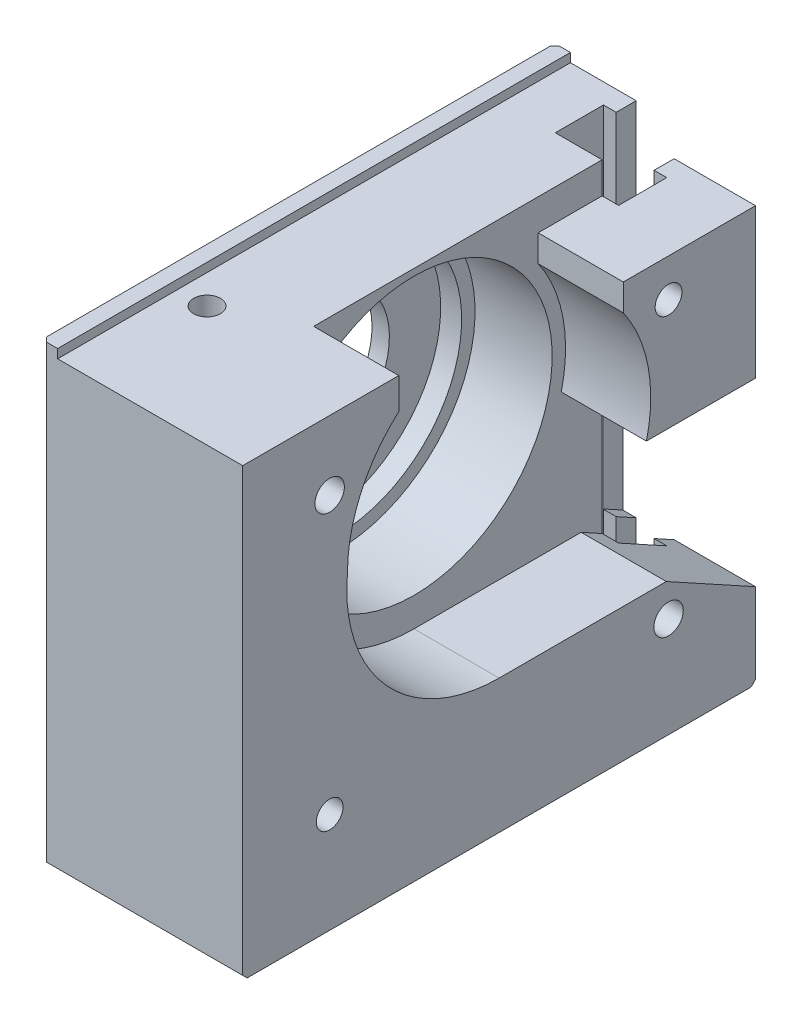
ISO-10303-21;
HEADER;
FILE_DESCRIPTION(('STEP AP214'),'2;1');
FILE_NAME('part.step','',(''),(''),'','','');
FILE_SCHEMA(('AUTOMOTIVE_DESIGN { 1 0 10303 214 1 1 1 1 }'));
ENDSEC;
DATA;
#1=APPLICATION_CONTEXT('core data for automotive mechanical design processes');
#2=APPLICATION_PROTOCOL_DEFINITION('international standard','automotive_design',2000,#1);
#3=PRODUCT_CONTEXT('',#1,'mechanical');
#4=PRODUCT('Part','Part','',(#3));
#5=PRODUCT_RELATED_PRODUCT_CATEGORY('part','',(#4));
#6=PRODUCT_DEFINITION_FORMATION('','',#4);
#7=PRODUCT_DEFINITION_CONTEXT('part definition',#1,'design');
#8=PRODUCT_DEFINITION('design','',#6,#7);
#9=PRODUCT_DEFINITION_SHAPE('','',#8);
#10=(LENGTH_UNIT() NAMED_UNIT(*) SI_UNIT(.MILLI.,.METRE.));
#11=(NAMED_UNIT(*) PLANE_ANGLE_UNIT() SI_UNIT($,.RADIAN.));
#12=(NAMED_UNIT(*) SI_UNIT($,.STERADIAN.) SOLID_ANGLE_UNIT());
#13=UNCERTAINTY_MEASURE_WITH_UNIT(LENGTH_MEASURE(1.E-05),#10,'distance_accuracy_value','');
#14=(GEOMETRIC_REPRESENTATION_CONTEXT(3) GLOBAL_UNCERTAINTY_ASSIGNED_CONTEXT((#13)) GLOBAL_UNIT_ASSIGNED_CONTEXT((#10,
#11,#12)) REPRESENTATION_CONTEXT('',''));
#15=CARTESIAN_POINT('',(0.,0.,0.));
#16=DIRECTION('',(0.,0.,1.));
#17=DIRECTION('',(1.,0.,0.));
#18=AXIS2_PLACEMENT_3D('',#15,#16,#17);
#19=CARTESIAN_POINT('',(-35.,84.,88.));
#20=DIRECTION('',(0.,1.,0.));
#21=DIRECTION('',(0.,0.,1.));
#22=AXIS2_PLACEMENT_3D('',#19,#20,#21);
#23=CONICAL_SURFACE('',#22,3.00000000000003,1.02974425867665);
#24=CARTESIAN_POINT('',(-35.,82.1974181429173,88.));
#25=VERTEX_POINT('',#24);
#26=VERTEX_LOOP('',#25);
#27=FACE_BOUND('',#26,.T.);
#28=CARTESIAN_POINT('',(-35.,84.,88.));
#29=DIRECTION('',(0.,1.,0.));
#30=DIRECTION('',(0.,0.,1.));
#31=AXIS2_PLACEMENT_3D('',#28,#29,#30);
#32=CIRCLE('',#31,3.);
#33=CARTESIAN_POINT('',(-35.,84.,91.));
#34=VERTEX_POINT('',#33);
#35=EDGE_CURVE('E373',#34,#34,#32,.T.);
#36=ORIENTED_EDGE('',*,*,#35,.T.);
#37=EDGE_LOOP('',(#36));
#38=FACE_BOUND('',#37,.T.);
#39=ADVANCED_FACE('F16',(#27,#38),#23,.F.);
#40=CARTESIAN_POINT('',(-27.75,67.5,57.5));
#41=DIRECTION('',(-1.,0.,0.));
#42=DIRECTION('',(0.,-1.,0.));
#43=AXIS2_PLACEMENT_3D('',#40,#41,#42);
#44=CYLINDRICAL_SURFACE('',#43,31.);
#45=CARTESIAN_POINT('',(-36.4,67.5,57.5));
#46=DIRECTION('',(-1.,0.,0.));
#47=DIRECTION('',(0.,-1.,0.));
#48=AXIS2_PLACEMENT_3D('',#45,#46,#47);
#49=CIRCLE('',#48,31.);
#50=CARTESIAN_POINT('',(-36.4,36.5,57.5));
#51=VERTEX_POINT('',#50);
#52=EDGE_CURVE('E363',#51,#51,#49,.T.);
#53=ORIENTED_EDGE('',*,*,#52,.T.);
#54=EDGE_LOOP('',(#53));
#55=FACE_BOUND('',#54,.T.);
#56=CARTESIAN_POINT('',(-19.1,67.5,57.5));
#57=DIRECTION('',(-1.,0.,0.));
#58=DIRECTION('',(0.,-1.,0.));
#59=AXIS2_PLACEMENT_3D('',#56,#57,#58);
#60=CIRCLE('',#59,31.);
#61=CARTESIAN_POINT('',(-19.1,36.5,57.5));
#62=VERTEX_POINT('',#61);
#63=EDGE_CURVE('E20',#62,#62,#60,.T.);
#64=ORIENTED_EDGE('',*,*,#63,.F.);
#65=EDGE_LOOP('',(#64));
#66=FACE_BOUND('',#65,.T.);
#67=ADVANCED_FACE('F525',(#55,#66),#44,.F.);
#68=CARTESIAN_POINT('',(-26.75,59.4901941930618,4.5));
#69=DIRECTION('',(0.,0.,1.));
#70=DIRECTION('',(1.,0.,0.));
#71=AXIS2_PLACEMENT_3D('',#68,#69,#70);
#72=PLANE('',#71);
#73=DIRECTION('',(1.,0.,0.));
#74=VECTOR('',#73,1.);
#75=CARTESIAN_POINT('',(-26.75,21.475,4.5));
#76=LINE('',#75,#74);
#77=CARTESIAN_POINT('',(-29.75,21.475,4.5));
#78=VERTEX_POINT('',#77);
#79=CARTESIAN_POINT('',(-29.6,21.475,4.5));
#80=VERTEX_POINT('',#79);
#81=EDGE_CURVE('E421',#78,#80,#76,.T.);
#82=ORIENTED_EDGE('',*,*,#81,.F.);
#83=DIRECTION('',(0.,1.,0.));
#84=VECTOR('',#83,1.);
#85=CARTESIAN_POINT('',(-29.75,39.7049169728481,4.5));
#86=LINE('',#85,#84);
#87=CARTESIAN_POINT('',(-29.75,59.4901941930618,4.5));
#88=VERTEX_POINT('',#87);
#89=EDGE_CURVE('E341',#88,#78,#86,.F.);
#90=ORIENTED_EDGE('',*,*,#89,.F.);
#91=DIRECTION('',(1.,0.,0.));
#92=VECTOR('',#91,1.);
#93=CARTESIAN_POINT('',(-26.75,59.4901941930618,4.5));
#94=LINE('',#93,#92);
#95=CARTESIAN_POINT('',(-29.6,59.4901941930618,4.5));
#96=VERTEX_POINT('',#95);
#97=EDGE_CURVE('E433',#96,#88,#94,.F.);
#98=ORIENTED_EDGE('',*,*,#97,.F.);
#99=DIRECTION('',(0.,1.,0.));
#100=VECTOR('',#99,1.);
#101=CARTESIAN_POINT('',(-29.6,0.,4.5));
#102=LINE('',#101,#100);
#103=EDGE_CURVE('E354',#96,#80,#102,.F.);
#104=ORIENTED_EDGE('',*,*,#103,.T.);
#105=EDGE_LOOP('',(#82,#90,#98,#104));
#106=FACE_BOUND('',#105,.T.);
#107=ADVANCED_FACE('F909',(#106),#72,.F.);
#108=CARTESIAN_POINT('',(-15.4,0.,4.5));
#109=DIRECTION('',(1.,0.,0.));
#110=DIRECTION('',(0.,0.,-1.));
#111=AXIS2_PLACEMENT_3D('',#108,#109,#110);
#112=PLANE('',#111);
#113=DIRECTION('',(0.,1.,0.));
#114=VECTOR('',#113,1.);
#115=CARTESIAN_POINT('',(-15.4,0.,15.3));
#116=LINE('',#115,#114);
#117=CARTESIAN_POINT('',(-15.4,59.4901941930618,15.3));
#118=VERTEX_POINT('',#117);
#119=CARTESIAN_POINT('',(-15.4,92.9901941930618,15.3));
#120=VERTEX_POINT('',#119);
#121=EDGE_CURVE('E353',#118,#120,#116,.T.);
#122=ORIENTED_EDGE('',*,*,#121,.T.);
#123=DIRECTION('',(0.,0.,-1.));
#124=VECTOR('',#123,1.);
#125=CARTESIAN_POINT('',(-15.4,92.9901941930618,29.6408483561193));
#126=LINE('',#125,#124);
#127=CARTESIAN_POINT('',(-15.4,92.9901941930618,4.5));
#128=VERTEX_POINT('',#127);
#129=EDGE_CURVE('E413',#120,#128,#126,.T.);
#130=ORIENTED_EDGE('',*,*,#129,.T.);
#131=DIRECTION('',(0.,1.,0.));
#132=VECTOR('',#131,1.);
#133=CARTESIAN_POINT('',(-15.4,0.,4.5));
#134=LINE('',#133,#132);
#135=CARTESIAN_POINT('',(-15.4,59.4901941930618,4.5));
#136=VERTEX_POINT('',#135);
#137=EDGE_CURVE('E418',#128,#136,#134,.F.);
#138=ORIENTED_EDGE('',*,*,#137,.T.);
#139=DIRECTION('',(0.,0.,1.));
#140=VECTOR('',#139,1.);
#141=CARTESIAN_POINT('',(-15.4,59.4901941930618,0.));
#142=LINE('',#141,#140);
#143=EDGE_CURVE('E429',#136,#118,#142,.T.);
#144=ORIENTED_EDGE('',*,*,#143,.T.);
#145=EDGE_LOOP('',(#122,#130,#138,#144));
#146=FACE_BOUND('',#145,.T.);
#147=ADVANCED_FACE('F882',(#146),#112,.F.);
#148=CARTESIAN_POINT('',(-18.25,0.,4.5));
#149=DIRECTION('',(0.,0.,-1.));
#150=DIRECTION('',(-1.,0.,0.));
#151=AXIS2_PLACEMENT_3D('',#148,#149,#150);
#152=PLANE('',#151);
#153=ORIENTED_EDGE('',*,*,#137,.F.);
#154=DIRECTION('',(1.,0.,0.));
#155=VECTOR('',#154,1.);
#156=CARTESIAN_POINT('',(0.,92.9901941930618,4.5));
#157=LINE('',#156,#155);
#158=CARTESIAN_POINT('',(-18.25,92.9901941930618,4.5));
#159=VERTEX_POINT('',#158);
#160=EDGE_CURVE('E415',#128,#159,#157,.F.);
#161=ORIENTED_EDGE('',*,*,#160,.T.);
#162=DIRECTION('',(0.,1.,0.));
#163=VECTOR('',#162,1.);
#164=CARTESIAN_POINT('',(-18.25,0.,4.5));
#165=LINE('',#164,#163);
#166=CARTESIAN_POINT('',(-18.25,59.4901941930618,4.5));
#167=VERTEX_POINT('',#166);
#168=EDGE_CURVE('E416',#159,#167,#165,.F.);
#169=ORIENTED_EDGE('',*,*,#168,.T.);
#170=DIRECTION('',(1.,0.,0.));
#171=VECTOR('',#170,1.);
#172=CARTESIAN_POINT('',(0.,59.4901941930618,4.5));
#173=LINE('',#172,#171);
#174=EDGE_CURVE('E426',#167,#136,#173,.T.);
#175=ORIENTED_EDGE('',*,*,#174,.T.);
#176=EDGE_LOOP('',(#153,#161,#169,#175));
#177=FACE_BOUND('',#176,.T.);
#178=ADVANCED_FACE('F884',(#177),#152,.F.);
#179=CARTESIAN_POINT('',(-18.25,0.,0.));
#180=DIRECTION('',(1.,0.,0.));
#181=DIRECTION('',(0.,0.,-1.));
#182=AXIS2_PLACEMENT_3D('',#179,#180,#181);
#183=PLANE('',#182);
#184=ORIENTED_EDGE('',*,*,#168,.F.);
#185=DIRECTION('',(0.,0.,-1.));
#186=VECTOR('',#185,1.);
#187=CARTESIAN_POINT('',(-18.25,92.9901941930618,29.6408483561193));
#188=LINE('',#187,#186);
#189=CARTESIAN_POINT('',(-18.25,92.9901941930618,0.));
#190=VERTEX_POINT('',#189);
#191=EDGE_CURVE('E311',#159,#190,#188,.T.);
#192=ORIENTED_EDGE('',*,*,#191,.T.);
#193=DIRECTION('',(0.,1.,0.));
#194=VECTOR('',#193,1.);
#195=CARTESIAN_POINT('',(-18.25,50.7176870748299,0.));
#196=LINE('',#195,#194);
#197=CARTESIAN_POINT('',(-18.25,59.4901941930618,0.));
#198=VERTEX_POINT('',#197);
#199=EDGE_CURVE('E317',#190,#198,#196,.F.);
#200=ORIENTED_EDGE('',*,*,#199,.T.);
#201=DIRECTION('',(0.,0.,1.));
#202=VECTOR('',#201,1.);
#203=CARTESIAN_POINT('',(-18.25,59.4901941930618,0.));
#204=LINE('',#203,#202);
#205=EDGE_CURVE('E405',#198,#167,#204,.T.);
#206=ORIENTED_EDGE('',*,*,#205,.T.);
#207=EDGE_LOOP('',(#184,#192,#200,#206));
#208=FACE_BOUND('',#207,.T.);
#209=ADVANCED_FACE('F895',(#208),#183,.F.);
#210=CARTESIAN_POINT('',(-29.6,0.,4.5));
#211=DIRECTION('',(0.,0.,-1.));
#212=DIRECTION('',(-1.,0.,0.));
#213=AXIS2_PLACEMENT_3D('',#210,#211,#212);
#214=PLANE('',#213);
#215=DIRECTION('',(0.,1.,0.));
#216=VECTOR('',#215,1.);
#217=CARTESIAN_POINT('',(-26.75,0.,4.5));
#218=LINE('',#217,#216);
#219=CARTESIAN_POINT('',(-26.75,59.4901941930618,4.5));
#220=VERTEX_POINT('',#219);
#221=CARTESIAN_POINT('',(-26.75,100.,4.5));
#222=VERTEX_POINT('',#221);
#223=EDGE_CURVE('E334',#220,#222,#218,.T.);
#224=ORIENTED_EDGE('',*,*,#223,.T.);
#225=DIRECTION('',(1.,0.,0.));
#226=VECTOR('',#225,1.);
#227=CARTESIAN_POINT('',(-41.5,100.,4.5));
#228=LINE('',#227,#226);
#229=CARTESIAN_POINT('',(-29.6,100.,4.5));
#230=VERTEX_POINT('',#229);
#231=EDGE_CURVE('E789',#230,#222,#228,.T.);
#232=ORIENTED_EDGE('',*,*,#231,.F.);
#233=DIRECTION('',(0.,1.,0.));
#234=VECTOR('',#233,1.);
#235=CARTESIAN_POINT('',(-29.6,0.,4.5));
#236=LINE('',#235,#234);
#237=EDGE_CURVE('E357',#230,#96,#236,.F.);
#238=ORIENTED_EDGE('',*,*,#237,.T.);
#239=DIRECTION('',(1.,0.,0.));
#240=VECTOR('',#239,1.);
#241=CARTESIAN_POINT('',(-26.75,59.4901941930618,4.5));
#242=LINE('',#241,#240);
#243=EDGE_CURVE('E339',#96,#220,#242,.T.);
#244=ORIENTED_EDGE('',*,*,#243,.T.);
#245=EDGE_LOOP('',(#224,#232,#238,#244));
#246=FACE_BOUND('',#245,.T.);
#247=ADVANCED_FACE('F897',(#246),#214,.F.);
#248=CARTESIAN_POINT('',(-19.1,65.9024094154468,38.2409378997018));
#249=DIRECTION('',(1.,0.,0.));
#250=DIRECTION('',(0.,0.,-1.));
#251=AXIS2_PLACEMENT_3D('',#248,#249,#250);
#252=PLANE('',#251);
#253=ORIENTED_EDGE('',*,*,#63,.T.);
#254=EDGE_LOOP('',(#253));
#255=FACE_BOUND('',#254,.T.);
#256=DIRECTION('',(0.,0.,-1.));
#257=VECTOR('',#256,1.);
#258=CARTESIAN_POINT('',(-19.1,30.,57.5));
#259=LINE('',#258,#257);
#260=CARTESIAN_POINT('',(-19.1,30.,57.5));
#261=VERTEX_POINT('',#260);
#262=CARTESIAN_POINT('',(-19.1,30.,20.));
#263=VERTEX_POINT('',#262);
#264=EDGE_CURVE('E388',#261,#263,#259,.T.);
#265=ORIENTED_EDGE('',*,*,#264,.T.);
#266=DIRECTION('',(0.,-0.481918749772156,-0.876215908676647));
#267=VECTOR('',#266,1.);
#268=CARTESIAN_POINT('',(-19.1,30.,20.));
#269=LINE('',#268,#267);
#270=CARTESIAN_POINT('',(-19.1,27.415,15.3));
#271=VERTEX_POINT('',#270);
#272=EDGE_CURVE('E366',#263,#271,#269,.T.);
#273=ORIENTED_EDGE('',*,*,#272,.T.);
#274=DIRECTION('',(0.,1.,0.));
#275=VECTOR('',#274,1.);
#276=CARTESIAN_POINT('',(-19.1,0.,15.3));
#277=LINE('',#276,#275);
#278=CARTESIAN_POINT('',(-19.1,59.4901941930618,15.3));
#279=VERTEX_POINT('',#278);
#280=EDGE_CURVE('E349',#271,#279,#277,.T.);
#281=ORIENTED_EDGE('',*,*,#280,.T.);
#282=DIRECTION('',(0.,0.,1.));
#283=VECTOR('',#282,1.);
#284=CARTESIAN_POINT('',(-19.1,59.4901941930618,0.));
#285=LINE('',#284,#283);
#286=CARTESIAN_POINT('',(-19.1,59.4901941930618,24.456952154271));
#287=VERTEX_POINT('',#286);
#288=EDGE_CURVE('E268',#279,#287,#285,.T.);
#289=ORIENTED_EDGE('',*,*,#288,.T.);
#290=CARTESIAN_POINT('',(-19.1,67.5,57.5));
#291=DIRECTION('',(-1.,0.,0.));
#292=DIRECTION('',(0.,0.,1.));
#293=AXIS2_PLACEMENT_3D('',#290,#291,#292);
#294=CIRCLE('',#293,34.);
#295=CARTESIAN_POINT('',(-19.1,86.9901941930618,29.6408483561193));
#296=VERTEX_POINT('',#295);
#297=EDGE_CURVE('E283',#287,#296,#294,.F.);
#298=ORIENTED_EDGE('',*,*,#297,.T.);
#299=DIRECTION('',(0.,1.,0.));
#300=VECTOR('',#299,1.);
#301=CARTESIAN_POINT('',(-19.1,86.9901941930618,29.6408483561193));
#302=LINE('',#301,#300);
#303=CARTESIAN_POINT('',(-19.1,92.9901941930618,29.6408483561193));
#304=VERTEX_POINT('',#303);
#305=EDGE_CURVE('E274',#296,#304,#302,.T.);
#306=ORIENTED_EDGE('',*,*,#305,.T.);
#307=DIRECTION('',(0.,0.,-1.));
#308=VECTOR('',#307,1.);
#309=CARTESIAN_POINT('',(-19.1,92.9901941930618,29.6408483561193));
#310=LINE('',#309,#308);
#311=CARTESIAN_POINT('',(-19.1,92.9901941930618,15.3));
#312=VERTEX_POINT('',#311);
#313=EDGE_CURVE('E310',#304,#312,#310,.T.);
#314=ORIENTED_EDGE('',*,*,#313,.T.);
#315=DIRECTION('',(0.,1.,0.));
#316=VECTOR('',#315,1.);
#317=CARTESIAN_POINT('',(-19.1,0.,15.3));
#318=LINE('',#317,#316);
#319=CARTESIAN_POINT('',(-19.1,100.,15.3));
#320=VERTEX_POINT('',#319);
#321=EDGE_CURVE('E350',#312,#320,#318,.T.);
#322=ORIENTED_EDGE('',*,*,#321,.T.);
#323=DIRECTION('',(0.,0.,1.));
#324=VECTOR('',#323,1.);
#325=CARTESIAN_POINT('',(-19.1,100.,0.));
#326=LINE('',#325,#324);
#327=CARTESIAN_POINT('',(-19.1,100.,80.));
#328=VERTEX_POINT('',#327);
#329=EDGE_CURVE('E383',#328,#320,#326,.F.);
#330=ORIENTED_EDGE('',*,*,#329,.F.);
#331=DIRECTION('',(0.,1.,0.));
#332=VECTOR('',#331,1.);
#333=CARTESIAN_POINT('',(-19.1,100.,80.));
#334=LINE('',#333,#332);
#335=CARTESIAN_POINT('',(-19.1,92.9901941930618,80.));
#336=VERTEX_POINT('',#335);
#337=EDGE_CURVE('E378',#328,#336,#334,.F.);
#338=ORIENTED_EDGE('',*,*,#337,.T.);
#339=CARTESIAN_POINT('',(-19.1,67.5,57.5));
#340=DIRECTION('',(-1.,0.,0.));
#341=DIRECTION('',(0.,0.,1.));
#342=AXIS2_PLACEMENT_3D('',#339,#340,#341);
#343=CIRCLE('',#342,34.);
#344=CARTESIAN_POINT('',(-19.1,67.5,91.5));
#345=VERTEX_POINT('',#344);
#346=EDGE_CURVE('E516',#336,#345,#343,.F.);
#347=ORIENTED_EDGE('',*,*,#346,.T.);
#348=CARTESIAN_POINT('',(-19.1,64.1633333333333,57.5));
#349=DIRECTION('',(-1.,0.,0.));
#350=DIRECTION('',(0.,0.,1.));
#351=AXIS2_PLACEMENT_3D('',#348,#349,#350);
#352=CIRCLE('',#351,34.1633333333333);
#353=EDGE_CURVE('E520',#345,#261,#352,.F.);
#354=ORIENTED_EDGE('',*,*,#353,.T.);
#355=EDGE_LOOP('',(#265,#273,#281,#289,#298,#306,#314,#322,#330,#338,#347,#354));
#356=FACE_BOUND('',#355,.T.);
#357=ADVANCED_FACE('F285',(#255,#356),#252,.T.);
#358=CARTESIAN_POINT('',(-35.,100.,88.));
#359=DIRECTION('',(0.,-1.,0.));
#360=DIRECTION('',(0.,0.,-1.));
#361=AXIS2_PLACEMENT_3D('',#358,#359,#360);
#362=CYLINDRICAL_SURFACE('',#361,3.);
#363=ORIENTED_EDGE('',*,*,#35,.F.);
#364=EDGE_LOOP('',(#363));
#365=FACE_BOUND('',#364,.T.);
#366=CARTESIAN_POINT('',(-35.,100.,88.));
#367=DIRECTION('',(0.,-1.,0.));
#368=DIRECTION('',(0.,0.,-1.));
#369=AXIS2_PLACEMENT_3D('',#366,#367,#368);
#370=CIRCLE('',#369,3.);
#371=CARTESIAN_POINT('',(-35.,100.,85.));
#372=VERTEX_POINT('',#371);
#373=EDGE_CURVE('E386',#372,#372,#370,.T.);
#374=ORIENTED_EDGE('',*,*,#373,.F.);
#375=EDGE_LOOP('',(#374));
#376=FACE_BOUND('',#375,.T.);
#377=ADVANCED_FACE('F531',(#365,#376),#362,.F.);
#378=CARTESIAN_POINT('',(-36.4,67.5,57.5));
#379=DIRECTION('',(-1.,0.,0.));
#380=DIRECTION('',(0.,0.,1.));
#381=AXIS2_PLACEMENT_3D('',#378,#379,#380);
#382=PLANE('',#381);
#383=CARTESIAN_POINT('',(-36.4,67.5,57.5));
#384=DIRECTION('',(-1.,0.,0.));
#385=DIRECTION('',(0.,-1.,0.));
#386=AXIS2_PLACEMENT_3D('',#383,#384,#385);
#387=CIRCLE('',#386,28.);
#388=CARTESIAN_POINT('',(-36.4,39.5,57.5));
#389=VERTEX_POINT('',#388);
#390=EDGE_CURVE('E371',#389,#389,#387,.T.);
#391=ORIENTED_EDGE('',*,*,#390,.T.);
#392=EDGE_LOOP('',(#391));
#393=FACE_BOUND('',#392,.T.);
#394=ORIENTED_EDGE('',*,*,#52,.F.);
#395=EDGE_LOOP('',(#394));
#396=FACE_BOUND('',#395,.T.);
#397=ADVANCED_FACE('F528',(#393,#396),#382,.F.);
#398=CARTESIAN_POINT('',(-18.25,0.,0.));
#399=DIRECTION('',(1.,0.,0.));
#400=DIRECTION('',(0.,0.,-1.));
#401=AXIS2_PLACEMENT_3D('',#398,#399,#400);
#402=PLANE('',#401);
#403=DIRECTION('',(0.,1.,0.));
#404=VECTOR('',#403,1.);
#405=CARTESIAN_POINT('',(-18.25,50.7176870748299,0.));
#406=LINE('',#405,#404);
#407=CARTESIAN_POINT('',(-18.25,19.,0.));
#408=VERTEX_POINT('',#407);
#409=CARTESIAN_POINT('',(-18.25,0.999999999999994,0.));
#410=VERTEX_POINT('',#409);
#411=EDGE_CURVE('E368',#408,#410,#406,.F.);
#412=ORIENTED_EDGE('',*,*,#411,.T.);
#413=DIRECTION('',(0.,0.707106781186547,-0.707106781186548));
#414=VECTOR('',#413,1.);
#415=CARTESIAN_POINT('',(-18.25,0.499999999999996,0.499999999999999));
#416=LINE('',#415,#414);
#417=CARTESIAN_POINT('',(-18.25,0.,0.999999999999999));
#418=VERTEX_POINT('',#417);
#419=EDGE_CURVE('E361',#418,#410,#416,.T.);
#420=ORIENTED_EDGE('',*,*,#419,.F.);
#421=DIRECTION('',(0.,0.,-1.));
#422=VECTOR('',#421,1.);
#423=CARTESIAN_POINT('',(-18.25,0.,0.));
#424=LINE('',#423,#422);
#425=CARTESIAN_POINT('',(-18.25,0.,4.5));
#426=VERTEX_POINT('',#425);
#427=EDGE_CURVE('E435',#426,#418,#424,.T.);
#428=ORIENTED_EDGE('',*,*,#427,.F.);
#429=DIRECTION('',(0.,1.,0.));
#430=VECTOR('',#429,1.);
#431=CARTESIAN_POINT('',(-18.25,0.,4.5));
#432=LINE('',#431,#430);
#433=CARTESIAN_POINT('',(-18.25,21.475,4.5));
#434=VERTEX_POINT('',#433);
#435=EDGE_CURVE('E346',#426,#434,#432,.T.);
#436=ORIENTED_EDGE('',*,*,#435,.T.);
#437=DIRECTION('',(0.,-0.481918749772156,-0.876215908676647));
#438=VECTOR('',#437,1.);
#439=CARTESIAN_POINT('',(-18.25,30.,20.));
#440=LINE('',#439,#438);
#441=EDGE_CURVE('E364',#434,#408,#440,.T.);
#442=ORIENTED_EDGE('',*,*,#441,.T.);
#443=EDGE_LOOP('',(#412,#420,#428,#436,#442));
#444=FACE_BOUND('',#443,.T.);
#445=ADVANCED_FACE('F530',(#444),#402,.F.);
#446=CARTESIAN_POINT('',(-11.391156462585,0.499999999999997,0.5));
#447=DIRECTION('',(0.,-0.707106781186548,-0.707106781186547));
#448=DIRECTION('',(0.,0.707106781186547,-0.707106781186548));
#449=AXIS2_PLACEMENT_3D('',#446,#447,#448);
#450=PLANE('',#449);
#451=DIRECTION('',(0.,0.707106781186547,-0.707106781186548));
#452=VECTOR('',#451,1.);
#453=CARTESIAN_POINT('',(0.,0.499999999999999,0.500000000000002));
#454=LINE('',#453,#452);
#455=CARTESIAN_POINT('',(0.,0.999999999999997,0.));
#456=VERTEX_POINT('',#455);
#457=CARTESIAN_POINT('',(0.,0.,1.));
#458=VERTEX_POINT('',#457);
#459=EDGE_CURVE('E359',#456,#458,#454,.F.);
#460=ORIENTED_EDGE('',*,*,#459,.T.);
#461=DIRECTION('',(1.,0.,0.));
#462=VECTOR('',#461,1.);
#463=CARTESIAN_POINT('',(0.,0.,1.));
#464=LINE('',#463,#462);
#465=EDGE_CURVE('E438',#418,#458,#464,.T.);
#466=ORIENTED_EDGE('',*,*,#465,.F.);
#467=ORIENTED_EDGE('',*,*,#419,.T.);
#468=DIRECTION('',(1.,0.,0.));
#469=VECTOR('',#468,1.);
#470=CARTESIAN_POINT('',(-22.7823129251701,0.999999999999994,0.));
#471=LINE('',#470,#469);
#472=EDGE_CURVE('E515',#410,#456,#471,.T.);
#473=ORIENTED_EDGE('',*,*,#472,.T.);
#474=EDGE_LOOP('',(#460,#466,#467,#473));
#475=FACE_BOUND('',#474,.T.);
#476=ADVANCED_FACE('F539',(#475),#450,.T.);
#477=CARTESIAN_POINT('',(-29.6,0.,4.5));
#478=DIRECTION('',(0.,0.,-1.));
#479=DIRECTION('',(-1.,0.,0.));
#480=AXIS2_PLACEMENT_3D('',#477,#478,#479);
#481=PLANE('',#480);
#482=DIRECTION('',(0.,1.,0.));
#483=VECTOR('',#482,1.);
#484=CARTESIAN_POINT('',(-29.6,0.,4.5));
#485=LINE('',#484,#483);
#486=CARTESIAN_POINT('',(-29.6,0.,4.5));
#487=VERTEX_POINT('',#486);
#488=EDGE_CURVE('E351',#80,#487,#485,.F.);
#489=ORIENTED_EDGE('',*,*,#488,.T.);
#490=DIRECTION('',(1.,0.,0.));
#491=VECTOR('',#490,1.);
#492=CARTESIAN_POINT('',(0.,0.,4.5));
#493=LINE('',#492,#491);
#494=CARTESIAN_POINT('',(-26.75,0.,4.5));
#495=VERTEX_POINT('',#494);
#496=EDGE_CURVE('E773',#495,#487,#493,.F.);
#497=ORIENTED_EDGE('',*,*,#496,.F.);
#498=DIRECTION('',(0.,1.,0.));
#499=VECTOR('',#498,1.);
#500=CARTESIAN_POINT('',(-26.75,0.,4.5));
#501=LINE('',#500,#499);
#502=CARTESIAN_POINT('',(-26.75,21.475,4.5));
#503=VERTEX_POINT('',#502);
#504=EDGE_CURVE('E327',#495,#503,#501,.T.);
#505=ORIENTED_EDGE('',*,*,#504,.T.);
#506=DIRECTION('',(1.,0.,0.));
#507=VECTOR('',#506,1.);
#508=CARTESIAN_POINT('',(-26.75,21.475,4.5));
#509=LINE('',#508,#507);
#510=EDGE_CURVE('E321',#503,#80,#509,.F.);
#511=ORIENTED_EDGE('',*,*,#510,.T.);
#512=EDGE_LOOP('',(#489,#497,#505,#511));
#513=FACE_BOUND('',#512,.T.);
#514=ADVANCED_FACE('F704',(#513),#481,.F.);
#515=CARTESIAN_POINT('',(-29.6,0.,15.3));
#516=DIRECTION('',(-1.,0.,0.));
#517=DIRECTION('',(0.,0.,1.));
#518=AXIS2_PLACEMENT_3D('',#515,#516,#517);
#519=PLANE('',#518);
#520=DIRECTION('',(0.,1.,0.));
#521=VECTOR('',#520,1.);
#522=CARTESIAN_POINT('',(-29.6,0.,15.3));
#523=LINE('',#522,#521);
#524=CARTESIAN_POINT('',(-29.6,100.,15.3));
#525=VERTEX_POINT('',#524);
#526=CARTESIAN_POINT('',(-29.6,0.,15.3));
#527=VERTEX_POINT('',#526);
#528=EDGE_CURVE('E347',#525,#527,#523,.F.);
#529=ORIENTED_EDGE('',*,*,#528,.T.);
#530=DIRECTION('',(0.,0.,-1.));
#531=VECTOR('',#530,1.);
#532=CARTESIAN_POINT('',(-29.6,0.,0.));
#533=LINE('',#532,#531);
#534=EDGE_CURVE('E450',#487,#527,#533,.F.);
#535=ORIENTED_EDGE('',*,*,#534,.F.);
#536=ORIENTED_EDGE('',*,*,#488,.F.);
#537=ORIENTED_EDGE('',*,*,#103,.F.);
#538=ORIENTED_EDGE('',*,*,#237,.F.);
#539=DIRECTION('',(0.,0.,1.));
#540=VECTOR('',#539,1.);
#541=CARTESIAN_POINT('',(-29.6,100.,0.));
#542=LINE('',#541,#540);
#543=EDGE_CURVE('E453',#525,#230,#542,.F.);
#544=ORIENTED_EDGE('',*,*,#543,.F.);
#545=EDGE_LOOP('',(#529,#535,#536,#537,#538,#544));
#546=FACE_BOUND('',#545,.T.);
#547=ADVANCED_FACE('F700',(#546),#519,.F.);
#548=CARTESIAN_POINT('',(-15.4,0.,15.3));
#549=DIRECTION('',(0.,0.,1.));
#550=DIRECTION('',(1.,0.,0.));
#551=AXIS2_PLACEMENT_3D('',#548,#549,#550);
#552=PLANE('',#551);
#553=ORIENTED_EDGE('',*,*,#280,.F.);
#554=DIRECTION('',(1.,0.,0.));
#555=VECTOR('',#554,1.);
#556=CARTESIAN_POINT('',(0.,27.415,15.3));
#557=LINE('',#556,#555);
#558=CARTESIAN_POINT('',(-15.4,27.415,15.3));
#559=VERTEX_POINT('',#558);
#560=EDGE_CURVE('E393',#271,#559,#557,.T.);
#561=ORIENTED_EDGE('',*,*,#560,.T.);
#562=DIRECTION('',(0.,1.,0.));
#563=VECTOR('',#562,1.);
#564=CARTESIAN_POINT('',(-15.4,0.,15.3));
#565=LINE('',#564,#563);
#566=CARTESIAN_POINT('',(-15.4,0.,15.3));
#567=VERTEX_POINT('',#566);
#568=EDGE_CURVE('E395',#559,#567,#565,.F.);
#569=ORIENTED_EDGE('',*,*,#568,.T.);
#570=DIRECTION('',(1.,0.,0.));
#571=VECTOR('',#570,1.);
#572=CARTESIAN_POINT('',(0.,0.,15.3));
#573=LINE('',#572,#571);
#574=EDGE_CURVE('E447',#527,#567,#573,.T.);
#575=ORIENTED_EDGE('',*,*,#574,.F.);
#576=ORIENTED_EDGE('',*,*,#528,.F.);
#577=DIRECTION('',(1.,0.,0.));
#578=VECTOR('',#577,1.);
#579=CARTESIAN_POINT('',(-41.5,100.,15.3));
#580=LINE('',#579,#578);
#581=EDGE_CURVE('E381',#320,#525,#580,.F.);
#582=ORIENTED_EDGE('',*,*,#581,.F.);
#583=ORIENTED_EDGE('',*,*,#321,.F.);
#584=DIRECTION('',(1.,0.,0.));
#585=VECTOR('',#584,1.);
#586=CARTESIAN_POINT('',(0.,92.9901941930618,15.3));
#587=LINE('',#586,#585);
#588=EDGE_CURVE('E302',#312,#120,#587,.T.);
#589=ORIENTED_EDGE('',*,*,#588,.T.);
#590=ORIENTED_EDGE('',*,*,#121,.F.);
#591=DIRECTION('',(1.,0.,0.));
#592=VECTOR('',#591,1.);
#593=CARTESIAN_POINT('',(0.,59.4901941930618,15.3));
#594=LINE('',#593,#592);
#595=EDGE_CURVE('E318',#118,#279,#594,.F.);
#596=ORIENTED_EDGE('',*,*,#595,.T.);
#597=EDGE_LOOP('',(#553,#561,#569,#575,#576,#582,#583,#589,#590,#596));
#598=FACE_BOUND('',#597,.T.);
#599=ADVANCED_FACE('F696',(#598),#552,.F.);
#600=CARTESIAN_POINT('',(-15.4,0.,4.5));
#601=DIRECTION('',(1.,0.,0.));
#602=DIRECTION('',(0.,0.,-1.));
#603=AXIS2_PLACEMENT_3D('',#600,#601,#602);
#604=PLANE('',#603);
#605=DIRECTION('',(0.,1.,0.));
#606=VECTOR('',#605,1.);
#607=CARTESIAN_POINT('',(-15.4,0.,4.5));
#608=LINE('',#607,#606);
#609=CARTESIAN_POINT('',(-15.4,21.475,4.5));
#610=VERTEX_POINT('',#609);
#611=CARTESIAN_POINT('',(-15.4,0.,4.5));
#612=VERTEX_POINT('',#611);
#613=EDGE_CURVE('E401',#610,#612,#608,.F.);
#614=ORIENTED_EDGE('',*,*,#613,.T.);
#615=DIRECTION('',(0.,0.,-1.));
#616=VECTOR('',#615,1.);
#617=CARTESIAN_POINT('',(-15.4,0.,0.));
#618=LINE('',#617,#616);
#619=EDGE_CURVE('E444',#567,#612,#618,.T.);
#620=ORIENTED_EDGE('',*,*,#619,.F.);
#621=ORIENTED_EDGE('',*,*,#568,.F.);
#622=DIRECTION('',(0.,-0.481918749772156,-0.876215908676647));
#623=VECTOR('',#622,1.);
#624=CARTESIAN_POINT('',(-15.4,30.,20.));
#625=LINE('',#624,#623);
#626=EDGE_CURVE('E288',#559,#610,#625,.T.);
#627=ORIENTED_EDGE('',*,*,#626,.T.);
#628=EDGE_LOOP('',(#614,#620,#621,#627));
#629=FACE_BOUND('',#628,.T.);
#630=ADVANCED_FACE('F692',(#629),#604,.F.);
#631=CARTESIAN_POINT('',(-18.25,0.,4.5));
#632=DIRECTION('',(0.,0.,-1.));
#633=DIRECTION('',(-1.,0.,0.));
#634=AXIS2_PLACEMENT_3D('',#631,#632,#633);
#635=PLANE('',#634);
#636=ORIENTED_EDGE('',*,*,#435,.F.);
#637=DIRECTION('',(1.,0.,0.));
#638=VECTOR('',#637,1.);
#639=CARTESIAN_POINT('',(0.,0.,4.5));
#640=LINE('',#639,#638);
#641=EDGE_CURVE('E440',#612,#426,#640,.F.);
#642=ORIENTED_EDGE('',*,*,#641,.F.);
#643=ORIENTED_EDGE('',*,*,#613,.F.);
#644=DIRECTION('',(1.,0.,0.));
#645=VECTOR('',#644,1.);
#646=CARTESIAN_POINT('',(0.,21.475,4.5));
#647=LINE('',#646,#645);
#648=EDGE_CURVE('E367',#610,#434,#647,.F.);
#649=ORIENTED_EDGE('',*,*,#648,.T.);
#650=EDGE_LOOP('',(#636,#642,#643,#649));
#651=FACE_BOUND('',#650,.T.);
#652=ADVANCED_FACE('F688',(#651),#635,.F.);
#653=CARTESIAN_POINT('',(-11.391156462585,0.499999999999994,114.5));
#654=DIRECTION('',(0.,-0.707106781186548,0.707106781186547));
#655=DIRECTION('',(0.,-0.707106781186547,-0.707106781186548));
#656=AXIS2_PLACEMENT_3D('',#653,#654,#655);
#657=PLANE('',#656);
#658=DIRECTION('',(0.,0.707106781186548,0.707106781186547));
#659=VECTOR('',#658,1.);
#660=CARTESIAN_POINT('',(-44.,0.,114.));
#661=LINE('',#660,#659);
#662=CARTESIAN_POINT('',(-44.,0.,114.));
#663=VERTEX_POINT('',#662);
#664=CARTESIAN_POINT('',(-44.,0.999999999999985,115.));
#665=VERTEX_POINT('',#664);
#666=EDGE_CURVE('E443',#663,#665,#661,.T.);
#667=ORIENTED_EDGE('',*,*,#666,.F.);
#668=DIRECTION('',(1.,0.,0.));
#669=VECTOR('',#668,1.);
#670=CARTESIAN_POINT('',(0.,0.,114.));
#671=LINE('',#670,#669);
#672=CARTESIAN_POINT('',(0.,0.,114.));
#673=VERTEX_POINT('',#672);
#674=EDGE_CURVE('E724',#673,#663,#671,.F.);
#675=ORIENTED_EDGE('',*,*,#674,.F.);
#676=DIRECTION('',(0.,-0.707106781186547,-0.707106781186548));
#677=VECTOR('',#676,1.);
#678=CARTESIAN_POINT('',(0.,0.499999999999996,114.5));
#679=LINE('',#678,#677);
#680=CARTESIAN_POINT('',(0.,0.999999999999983,115.));
#681=VERTEX_POINT('',#680);
#682=EDGE_CURVE('E344',#673,#681,#679,.F.);
#683=ORIENTED_EDGE('',*,*,#682,.T.);
#684=DIRECTION('',(1.,0.,0.));
#685=VECTOR('',#684,1.);
#686=CARTESIAN_POINT('',(-22.7823129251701,0.99999999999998,115.));
#687=LINE('',#686,#685);
#688=EDGE_CURVE('E766',#665,#681,#687,.T.);
#689=ORIENTED_EDGE('',*,*,#688,.F.);
#690=EDGE_LOOP('',(#667,#675,#683,#689));
#691=FACE_BOUND('',#690,.T.);
#692=ADVANCED_FACE('F684',(#691),#657,.T.);
#693=CARTESIAN_POINT('',(-29.75,39.7049169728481,2.18682005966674));
#694=DIRECTION('',(1.,0.,0.));
#695=DIRECTION('',(0.,0.,-1.));
#696=AXIS2_PLACEMENT_3D('',#693,#694,#695);
#697=PLANE('',#696);
#698=DIRECTION('',(0.,0.,1.));
#699=VECTOR('',#698,1.);
#700=CARTESIAN_POINT('',(-29.75,59.4901941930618,0.));
#701=LINE('',#700,#699);
#702=CARTESIAN_POINT('',(-29.75,59.4901941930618,0.));
#703=VERTEX_POINT('',#702);
#704=EDGE_CURVE('E336',#703,#88,#701,.T.);
#705=ORIENTED_EDGE('',*,*,#704,.T.);
#706=ORIENTED_EDGE('',*,*,#89,.T.);
#707=DIRECTION('',(0.,-0.481918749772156,-0.876215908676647));
#708=VECTOR('',#707,1.);
#709=CARTESIAN_POINT('',(-29.75,21.475,4.5));
#710=LINE('',#709,#708);
#711=CARTESIAN_POINT('',(-29.75,19.,0.));
#712=VERTEX_POINT('',#711);
#713=EDGE_CURVE('E319',#78,#712,#710,.T.);
#714=ORIENTED_EDGE('',*,*,#713,.T.);
#715=DIRECTION('',(0.,1.,0.));
#716=VECTOR('',#715,1.);
#717=CARTESIAN_POINT('',(-29.75,50.7176870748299,0.));
#718=LINE('',#717,#716);
#719=EDGE_CURVE('E756',#712,#703,#718,.T.);
#720=ORIENTED_EDGE('',*,*,#719,.T.);
#721=EDGE_LOOP('',(#705,#706,#714,#720));
#722=FACE_BOUND('',#721,.T.);
#723=ADVANCED_FACE('F680',(#722),#697,.T.);
#724=CARTESIAN_POINT('',(-26.75,59.4901941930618,0.));
#725=DIRECTION('',(0.,1.,0.));
#726=DIRECTION('',(0.,0.,1.));
#727=AXIS2_PLACEMENT_3D('',#724,#725,#726);
#728=PLANE('',#727);
#729=DIRECTION('',(1.,0.,0.));
#730=VECTOR('',#729,1.);
#731=CARTESIAN_POINT('',(-22.7823129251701,59.4901941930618,0.));
#732=LINE('',#731,#730);
#733=CARTESIAN_POINT('',(-26.75,59.4901941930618,0.));
#734=VERTEX_POINT('',#733);
#735=EDGE_CURVE('E754',#703,#734,#732,.T.);
#736=ORIENTED_EDGE('',*,*,#735,.T.);
#737=DIRECTION('',(0.,0.,1.));
#738=VECTOR('',#737,1.);
#739=CARTESIAN_POINT('',(-26.75,59.4901941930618,4.5));
#740=LINE('',#739,#738);
#741=EDGE_CURVE('E331',#734,#220,#740,.T.);
#742=ORIENTED_EDGE('',*,*,#741,.T.);
#743=ORIENTED_EDGE('',*,*,#243,.F.);
#744=ORIENTED_EDGE('',*,*,#97,.T.);
#745=ORIENTED_EDGE('',*,*,#704,.F.);
#746=EDGE_LOOP('',(#736,#742,#743,#744,#745));
#747=FACE_BOUND('',#746,.T.);
#748=ADVANCED_FACE('F676',(#747),#728,.F.);
#749=CARTESIAN_POINT('',(-26.75,0.,4.5));
#750=DIRECTION('',(-1.,0.,0.));
#751=DIRECTION('',(0.,0.,1.));
#752=AXIS2_PLACEMENT_3D('',#749,#750,#751);
#753=PLANE('',#752);
#754=DIRECTION('',(0.,1.,0.));
#755=VECTOR('',#754,1.);
#756=CARTESIAN_POINT('',(-26.75,50.7176870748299,0.));
#757=LINE('',#756,#755);
#758=CARTESIAN_POINT('',(-26.75,100.,0.));
#759=VERTEX_POINT('',#758);
#760=EDGE_CURVE('E752',#734,#759,#757,.T.);
#761=ORIENTED_EDGE('',*,*,#760,.T.);
#762=DIRECTION('',(0.,0.,1.));
#763=VECTOR('',#762,1.);
#764=CARTESIAN_POINT('',(-26.75,100.,0.));
#765=LINE('',#764,#763);
#766=EDGE_CURVE('E786',#222,#759,#765,.F.);
#767=ORIENTED_EDGE('',*,*,#766,.F.);
#768=ORIENTED_EDGE('',*,*,#223,.F.);
#769=ORIENTED_EDGE('',*,*,#741,.F.);
#770=EDGE_LOOP('',(#761,#767,#768,#769));
#771=FACE_BOUND('',#770,.T.);
#772=ADVANCED_FACE('F672',(#771),#753,.F.);
#773=CARTESIAN_POINT('',(-11.391156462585,0.499999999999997,0.5));
#774=DIRECTION('',(0.,-0.707106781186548,-0.707106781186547));
#775=DIRECTION('',(0.,0.707106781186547,-0.707106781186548));
#776=AXIS2_PLACEMENT_3D('',#773,#774,#775);
#777=PLANE('',#776);
#778=DIRECTION('',(0.,-0.707106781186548,0.707106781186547));
#779=VECTOR('',#778,1.);
#780=CARTESIAN_POINT('',(-44.,0.999999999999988,0.));
#781=LINE('',#780,#779);
#782=CARTESIAN_POINT('',(-44.,0.999999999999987,0.));
#783=VERTEX_POINT('',#782);
#784=CARTESIAN_POINT('',(-44.,0.,0.999999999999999));
#785=VERTEX_POINT('',#784);
#786=EDGE_CURVE('E439',#783,#785,#781,.T.);
#787=ORIENTED_EDGE('',*,*,#786,.F.);
#788=DIRECTION('',(1.,0.,0.));
#789=VECTOR('',#788,1.);
#790=CARTESIAN_POINT('',(-22.7823129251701,0.999999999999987,0.));
#791=LINE('',#790,#789);
#792=CARTESIAN_POINT('',(-26.75,0.99999999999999,0.));
#793=VERTEX_POINT('',#792);
#794=EDGE_CURVE('E746',#783,#793,#791,.T.);
#795=ORIENTED_EDGE('',*,*,#794,.T.);
#796=DIRECTION('',(0.,-0.707106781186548,0.707106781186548));
#797=VECTOR('',#796,1.);
#798=CARTESIAN_POINT('',(-26.75,0.999999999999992,0.));
#799=LINE('',#798,#797);
#800=CARTESIAN_POINT('',(-26.75,0.,1.));
#801=VERTEX_POINT('',#800);
#802=EDGE_CURVE('E329',#793,#801,#799,.T.);
#803=ORIENTED_EDGE('',*,*,#802,.T.);
#804=DIRECTION('',(1.,0.,0.));
#805=VECTOR('',#804,1.);
#806=CARTESIAN_POINT('',(0.,0.,1.));
#807=LINE('',#806,#805);
#808=EDGE_CURVE('E779',#785,#801,#807,.T.);
#809=ORIENTED_EDGE('',*,*,#808,.F.);
#810=EDGE_LOOP('',(#787,#795,#803,#809));
#811=FACE_BOUND('',#810,.T.);
#812=ADVANCED_FACE('F668',(#811),#777,.T.);
#813=CARTESIAN_POINT('',(-26.75,0.,4.5));
#814=DIRECTION('',(-1.,0.,0.));
#815=DIRECTION('',(0.,0.,1.));
#816=AXIS2_PLACEMENT_3D('',#813,#814,#815);
#817=PLANE('',#816);
#818=ORIENTED_EDGE('',*,*,#504,.F.);
#819=DIRECTION('',(0.,0.,-1.));
#820=VECTOR('',#819,1.);
#821=CARTESIAN_POINT('',(-26.75,0.,0.));
#822=LINE('',#821,#820);
#823=EDGE_CURVE('E776',#801,#495,#822,.F.);
#824=ORIENTED_EDGE('',*,*,#823,.F.);
#825=ORIENTED_EDGE('',*,*,#802,.F.);
#826=DIRECTION('',(0.,1.,0.));
#827=VECTOR('',#826,1.);
#828=CARTESIAN_POINT('',(-26.75,50.7176870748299,0.));
#829=LINE('',#828,#827);
#830=CARTESIAN_POINT('',(-26.75,19.,0.));
#831=VERTEX_POINT('',#830);
#832=EDGE_CURVE('E744',#793,#831,#829,.T.);
#833=ORIENTED_EDGE('',*,*,#832,.T.);
#834=DIRECTION('',(0.,-0.481918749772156,-0.876215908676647));
#835=VECTOR('',#834,1.);
#836=CARTESIAN_POINT('',(-26.75,21.475,4.5));
#837=LINE('',#836,#835);
#838=EDGE_CURVE('E324',#831,#503,#837,.F.);
#839=ORIENTED_EDGE('',*,*,#838,.T.);
#840=EDGE_LOOP('',(#818,#824,#825,#833,#839));
#841=FACE_BOUND('',#840,.T.);
#842=ADVANCED_FACE('F664',(#841),#817,.F.);
#843=CARTESIAN_POINT('',(-26.75,21.475,4.5));
#844=DIRECTION('',(0.,-0.876215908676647,0.481918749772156));
#845=DIRECTION('',(0.,-0.481918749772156,-0.876215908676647));
#846=AXIS2_PLACEMENT_3D('',#843,#844,#845);
#847=PLANE('',#846);
#848=ORIENTED_EDGE('',*,*,#81,.T.);
#849=ORIENTED_EDGE('',*,*,#510,.F.);
#850=ORIENTED_EDGE('',*,*,#838,.F.);
#851=DIRECTION('',(1.,0.,0.));
#852=VECTOR('',#851,1.);
#853=CARTESIAN_POINT('',(-22.7823129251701,19.,0.));
#854=LINE('',#853,#852);
#855=EDGE_CURVE('E510',#831,#712,#854,.F.);
#856=ORIENTED_EDGE('',*,*,#855,.T.);
#857=ORIENTED_EDGE('',*,*,#713,.F.);
#858=EDGE_LOOP('',(#848,#849,#850,#856,#857));
#859=FACE_BOUND('',#858,.T.);
#860=ADVANCED_FACE('F660',(#859),#847,.F.);
#861=CARTESIAN_POINT('',(0.,59.4901941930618,0.));
#862=DIRECTION('',(0.,1.,0.));
#863=DIRECTION('',(0.,0.,1.));
#864=AXIS2_PLACEMENT_3D('',#861,#862,#863);
#865=PLANE('',#864);
#866=ORIENTED_EDGE('',*,*,#143,.F.);
#867=ORIENTED_EDGE('',*,*,#174,.F.);
#868=ORIENTED_EDGE('',*,*,#205,.F.);
#869=DIRECTION('',(1.,0.,0.));
#870=VECTOR('',#869,1.);
#871=CARTESIAN_POINT('',(-22.7823129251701,59.4901941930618,0.));
#872=LINE('',#871,#870);
#873=CARTESIAN_POINT('',(0.,59.4901941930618,0.));
#874=VERTEX_POINT('',#873);
#875=EDGE_CURVE('E315',#198,#874,#872,.T.);
#876=ORIENTED_EDGE('',*,*,#875,.T.);
#877=DIRECTION('',(0.,0.,-1.));
#878=VECTOR('',#877,1.);
#879=CARTESIAN_POINT('',(0.,59.4901941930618,0.));
#880=LINE('',#879,#878);
#881=CARTESIAN_POINT('',(0.,59.4901941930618,24.456952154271));
#882=VERTEX_POINT('',#881);
#883=EDGE_CURVE('E314',#882,#874,#880,.T.);
#884=ORIENTED_EDGE('',*,*,#883,.F.);
#885=DIRECTION('',(-1.,0.,0.));
#886=VECTOR('',#885,1.);
#887=CARTESIAN_POINT('',(0.,59.4901941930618,24.456952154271));
#888=LINE('',#887,#886);
#889=EDGE_CURVE('E289',#882,#287,#888,.T.);
#890=ORIENTED_EDGE('',*,*,#889,.T.);
#891=ORIENTED_EDGE('',*,*,#288,.F.);
#892=ORIENTED_EDGE('',*,*,#595,.F.);
#893=EDGE_LOOP('',(#866,#867,#868,#876,#884,#890,#891,#892));
#894=FACE_BOUND('',#893,.T.);
#895=ADVANCED_FACE('F656',(#894),#865,.F.);
#896=CARTESIAN_POINT('',(-22.7823129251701,50.7176870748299,0.));
#897=DIRECTION('',(0.,0.,1.));
#898=DIRECTION('',(1.,0.,0.));
#899=AXIS2_PLACEMENT_3D('',#896,#897,#898);
#900=PLANE('',#899);
#901=DIRECTION('',(1.,0.,0.));
#902=VECTOR('',#901,1.);
#903=CARTESIAN_POINT('',(0.,92.9901941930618,0.));
#904=LINE('',#903,#902);
#905=CARTESIAN_POINT('',(0.,92.9901941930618,0.));
#906=VERTEX_POINT('',#905);
#907=EDGE_CURVE('E308',#190,#906,#904,.T.);
#908=ORIENTED_EDGE('',*,*,#907,.T.);
#909=DIRECTION('',(0.,1.,0.));
#910=VECTOR('',#909,1.);
#911=CARTESIAN_POINT('',(0.,100.,0.));
#912=LINE('',#911,#910);
#913=EDGE_CURVE('E307',#874,#906,#912,.T.);
#914=ORIENTED_EDGE('',*,*,#913,.F.);
#915=ORIENTED_EDGE('',*,*,#875,.F.);
#916=ORIENTED_EDGE('',*,*,#199,.F.);
#917=EDGE_LOOP('',(#908,#914,#915,#916));
#918=FACE_BOUND('',#917,.T.);
#919=ADVANCED_FACE('F652',(#918),#900,.F.);
#920=CARTESIAN_POINT('',(0.,92.9901941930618,29.6408483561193));
#921=DIRECTION('',(0.,-1.,0.));
#922=DIRECTION('',(0.,0.,-1.));
#923=AXIS2_PLACEMENT_3D('',#920,#921,#922);
#924=PLANE('',#923);
#925=ORIENTED_EDGE('',*,*,#313,.F.);
#926=DIRECTION('',(-1.,0.,0.));
#927=VECTOR('',#926,1.);
#928=CARTESIAN_POINT('',(0.,92.9901941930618,29.6408483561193));
#929=LINE('',#928,#927);
#930=CARTESIAN_POINT('',(0.,92.9901941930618,29.6408483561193));
#931=VERTEX_POINT('',#930);
#932=EDGE_CURVE('E280',#304,#931,#929,.F.);
#933=ORIENTED_EDGE('',*,*,#932,.T.);
#934=DIRECTION('',(0.,0.,-1.));
#935=VECTOR('',#934,1.);
#936=CARTESIAN_POINT('',(0.,92.9901941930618,0.));
#937=LINE('',#936,#935);
#938=EDGE_CURVE('E303',#906,#931,#937,.F.);
#939=ORIENTED_EDGE('',*,*,#938,.F.);
#940=ORIENTED_EDGE('',*,*,#907,.F.);
#941=ORIENTED_EDGE('',*,*,#191,.F.);
#942=ORIENTED_EDGE('',*,*,#160,.F.);
#943=ORIENTED_EDGE('',*,*,#129,.F.);
#944=ORIENTED_EDGE('',*,*,#588,.F.);
#945=EDGE_LOOP('',(#925,#933,#939,#940,#941,#942,#943,#944));
#946=FACE_BOUND('',#945,.T.);
#947=ADVANCED_FACE('F649',(#946),#924,.F.);
#948=CARTESIAN_POINT('',(0.,86.9901941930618,29.6408483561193));
#949=DIRECTION('',(0.,0.,-1.));
#950=DIRECTION('',(-1.,0.,0.));
#951=AXIS2_PLACEMENT_3D('',#948,#949,#950);
#952=PLANE('',#951);
#953=DIRECTION('',(-1.,0.,0.));
#954=VECTOR('',#953,1.);
#955=CARTESIAN_POINT('',(0.,86.9901941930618,29.6408483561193));
#956=LINE('',#955,#954);
#957=CARTESIAN_POINT('',(0.,86.9901941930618,29.6408483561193));
#958=VERTEX_POINT('',#957);
#959=EDGE_CURVE('E278',#296,#958,#956,.F.);
#960=ORIENTED_EDGE('',*,*,#959,.T.);
#961=DIRECTION('',(0.,1.,0.));
#962=VECTOR('',#961,1.);
#963=CARTESIAN_POINT('',(0.,100.,29.6408483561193));
#964=LINE('',#963,#962);
#965=EDGE_CURVE('E306',#931,#958,#964,.F.);
#966=ORIENTED_EDGE('',*,*,#965,.F.);
#967=ORIENTED_EDGE('',*,*,#932,.F.);
#968=ORIENTED_EDGE('',*,*,#305,.F.);
#969=EDGE_LOOP('',(#960,#966,#967,#968));
#970=FACE_BOUND('',#969,.T.);
#971=ADVANCED_FACE('F275',(#970),#952,.F.);
#972=CARTESIAN_POINT('',(0.,67.5,57.5));
#973=DIRECTION('',(-1.,0.,0.));
#974=DIRECTION('',(0.,0.,1.));
#975=AXIS2_PLACEMENT_3D('',#972,#973,#974);
#976=CYLINDRICAL_SURFACE('',#975,34.);
#977=ORIENTED_EDGE('',*,*,#889,.F.);
#978=CARTESIAN_POINT('',(0.,67.5,57.5));
#979=DIRECTION('',(-1.,0.,0.));
#980=DIRECTION('',(0.,0.,1.));
#981=AXIS2_PLACEMENT_3D('',#978,#979,#980);
#982=CIRCLE('',#981,34.);
#983=EDGE_CURVE('E293',#958,#882,#982,.T.);
#984=ORIENTED_EDGE('',*,*,#983,.F.);
#985=ORIENTED_EDGE('',*,*,#959,.F.);
#986=ORIENTED_EDGE('',*,*,#297,.F.);
#987=EDGE_LOOP('',(#977,#984,#985,#986));
#988=FACE_BOUND('',#987,.T.);
#989=ADVANCED_FACE('F291',(#988),#976,.F.);
#990=CARTESIAN_POINT('',(0.,30.,20.));
#991=DIRECTION('',(0.,-0.876215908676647,0.481918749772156));
#992=DIRECTION('',(0.,-0.481918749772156,-0.876215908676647));
#993=AXIS2_PLACEMENT_3D('',#990,#991,#992);
#994=PLANE('',#993);
#995=ORIENTED_EDGE('',*,*,#272,.F.);
#996=DIRECTION('',(1.,0.,0.));
#997=VECTOR('',#996,1.);
#998=CARTESIAN_POINT('',(0.,30.,20.));
#999=LINE('',#998,#997);
#1000=CARTESIAN_POINT('',(0.,30.,20.));
#1001=VERTEX_POINT('',#1000);
#1002=EDGE_CURVE('E391',#263,#1001,#999,.T.);
#1003=ORIENTED_EDGE('',*,*,#1002,.T.);
#1004=DIRECTION('',(0.,0.481918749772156,0.876215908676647));
#1005=VECTOR('',#1004,1.);
#1006=CARTESIAN_POINT('',(0.,19.,0.));
#1007=LINE('',#1006,#1005);
#1008=CARTESIAN_POINT('',(0.,19.,0.));
#1009=VERTEX_POINT('',#1008);
#1010=EDGE_CURVE('E503',#1009,#1001,#1007,.T.);
#1011=ORIENTED_EDGE('',*,*,#1010,.F.);
#1012=DIRECTION('',(1.,0.,0.));
#1013=VECTOR('',#1012,1.);
#1014=CARTESIAN_POINT('',(-22.7823129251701,19.,0.));
#1015=LINE('',#1014,#1013);
#1016=EDGE_CURVE('E372',#1009,#408,#1015,.F.);
#1017=ORIENTED_EDGE('',*,*,#1016,.T.);
#1018=ORIENTED_EDGE('',*,*,#441,.F.);
#1019=ORIENTED_EDGE('',*,*,#648,.F.);
#1020=ORIENTED_EDGE('',*,*,#626,.F.);
#1021=ORIENTED_EDGE('',*,*,#560,.F.);
#1022=EDGE_LOOP('',(#995,#1003,#1011,#1017,#1018,#1019,#1020,#1021));
#1023=FACE_BOUND('',#1022,.T.);
#1024=ADVANCED_FACE('F640',(#1023),#994,.F.);
#1025=CARTESIAN_POINT('',(0.,30.,57.5));
#1026=DIRECTION('',(0.,-1.,0.));
#1027=DIRECTION('',(0.,0.,-1.));
#1028=AXIS2_PLACEMENT_3D('',#1025,#1026,#1027);
#1029=PLANE('',#1028);
#1030=DIRECTION('',(-1.,0.,0.));
#1031=VECTOR('',#1030,1.);
#1032=CARTESIAN_POINT('',(0.,30.,57.5));
#1033=LINE('',#1032,#1031);
#1034=CARTESIAN_POINT('',(0.,30.,57.5));
#1035=VERTEX_POINT('',#1034);
#1036=EDGE_CURVE('E390',#261,#1035,#1033,.F.);
#1037=ORIENTED_EDGE('',*,*,#1036,.T.);
#1038=DIRECTION('',(0.,0.,-1.));
#1039=VECTOR('',#1038,1.);
#1040=CARTESIAN_POINT('',(0.,30.,0.));
#1041=LINE('',#1040,#1039);
#1042=EDGE_CURVE('E501',#1001,#1035,#1041,.F.);
#1043=ORIENTED_EDGE('',*,*,#1042,.F.);
#1044=ORIENTED_EDGE('',*,*,#1002,.F.);
#1045=ORIENTED_EDGE('',*,*,#264,.F.);
#1046=EDGE_LOOP('',(#1037,#1043,#1044,#1045));
#1047=FACE_BOUND('',#1046,.T.);
#1048=ADVANCED_FACE('F636',(#1047),#1029,.F.);
#1049=CARTESIAN_POINT('',(0.,64.1633333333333,57.5));
#1050=DIRECTION('',(-1.,0.,0.));
#1051=DIRECTION('',(0.,0.,1.));
#1052=AXIS2_PLACEMENT_3D('',#1049,#1050,#1051);
#1053=CYLINDRICAL_SURFACE('',#1052,34.1633333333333);
#1054=DIRECTION('',(-1.,0.,0.));
#1055=VECTOR('',#1054,1.);
#1056=CARTESIAN_POINT('',(0.,67.5,91.5));
#1057=LINE('',#1056,#1055);
#1058=CARTESIAN_POINT('',(0.,67.5,91.5));
#1059=VERTEX_POINT('',#1058);
#1060=EDGE_CURVE('E519',#345,#1059,#1057,.F.);
#1061=ORIENTED_EDGE('',*,*,#1060,.T.);
#1062=CARTESIAN_POINT('',(0.,64.1633333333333,57.5));
#1063=DIRECTION('',(-1.,0.,0.));
#1064=DIRECTION('',(0.,0.,1.));
#1065=AXIS2_PLACEMENT_3D('',#1062,#1063,#1064);
#1066=CIRCLE('',#1065,34.1633333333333);
#1067=EDGE_CURVE('E498',#1035,#1059,#1066,.T.);
#1068=ORIENTED_EDGE('',*,*,#1067,.F.);
#1069=ORIENTED_EDGE('',*,*,#1036,.F.);
#1070=ORIENTED_EDGE('',*,*,#353,.F.);
#1071=EDGE_LOOP('',(#1061,#1068,#1069,#1070));
#1072=FACE_BOUND('',#1071,.T.);
#1073=ADVANCED_FACE('F632',(#1072),#1053,.F.);
#1074=CARTESIAN_POINT('',(0.,67.5,57.5));
#1075=DIRECTION('',(-1.,0.,0.));
#1076=DIRECTION('',(0.,0.,1.));
#1077=AXIS2_PLACEMENT_3D('',#1074,#1075,#1076);
#1078=CYLINDRICAL_SURFACE('',#1077,34.);
#1079=DIRECTION('',(1.,0.,0.));
#1080=VECTOR('',#1079,1.);
#1081=CARTESIAN_POINT('',(0.,92.9901941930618,80.));
#1082=LINE('',#1081,#1080);
#1083=CARTESIAN_POINT('',(0.,92.9901941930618,80.));
#1084=VERTEX_POINT('',#1083);
#1085=EDGE_CURVE('E382',#336,#1084,#1082,.T.);
#1086=ORIENTED_EDGE('',*,*,#1085,.T.);
#1087=CARTESIAN_POINT('',(0.,67.5,57.5));
#1088=DIRECTION('',(-1.,0.,0.));
#1089=DIRECTION('',(0.,0.,1.));
#1090=AXIS2_PLACEMENT_3D('',#1087,#1088,#1089);
#1091=CIRCLE('',#1090,34.);
#1092=EDGE_CURVE('E494',#1059,#1084,#1091,.T.);
#1093=ORIENTED_EDGE('',*,*,#1092,.F.);
#1094=ORIENTED_EDGE('',*,*,#1060,.F.);
#1095=ORIENTED_EDGE('',*,*,#346,.F.);
#1096=EDGE_LOOP('',(#1086,#1093,#1094,#1095));
#1097=FACE_BOUND('',#1096,.T.);
#1098=ADVANCED_FACE('F628',(#1097),#1078,.F.);
#1099=CARTESIAN_POINT('',(0.,100.,80.));
#1100=DIRECTION('',(0.,0.,1.));
#1101=DIRECTION('',(1.,0.,0.));
#1102=AXIS2_PLACEMENT_3D('',#1099,#1100,#1101);
#1103=PLANE('',#1102);
#1104=DIRECTION('',(1.,0.,0.));
#1105=VECTOR('',#1104,1.);
#1106=CARTESIAN_POINT('',(-41.5,100.,80.));
#1107=LINE('',#1106,#1105);
#1108=CARTESIAN_POINT('',(0.,100.,80.));
#1109=VERTEX_POINT('',#1108);
#1110=EDGE_CURVE('E387',#1109,#328,#1107,.F.);
#1111=ORIENTED_EDGE('',*,*,#1110,.F.);
#1112=DIRECTION('',(0.,1.,0.));
#1113=VECTOR('',#1112,1.);
#1114=CARTESIAN_POINT('',(0.,100.,80.));
#1115=LINE('',#1114,#1113);
#1116=EDGE_CURVE('E497',#1084,#1109,#1115,.T.);
#1117=ORIENTED_EDGE('',*,*,#1116,.F.);
#1118=ORIENTED_EDGE('',*,*,#1085,.F.);
#1119=ORIENTED_EDGE('',*,*,#337,.F.);
#1120=EDGE_LOOP('',(#1111,#1117,#1118,#1119));
#1121=FACE_BOUND('',#1120,.T.);
#1122=ADVANCED_FACE('F624',(#1121),#1103,.F.);
#1123=CARTESIAN_POINT('',(-41.5,100.,0.));
#1124=DIRECTION('',(0.,1.,0.));
#1125=DIRECTION('',(0.,0.,1.));
#1126=AXIS2_PLACEMENT_3D('',#1123,#1124,#1125);
#1127=PLANE('',#1126);
#1128=ORIENTED_EDGE('',*,*,#373,.T.);
#1129=EDGE_LOOP('',(#1128));
#1130=FACE_BOUND('',#1129,.T.);
#1131=ORIENTED_EDGE('',*,*,#1110,.T.);
#1132=ORIENTED_EDGE('',*,*,#329,.T.);
#1133=ORIENTED_EDGE('',*,*,#581,.T.);
#1134=ORIENTED_EDGE('',*,*,#543,.T.);
#1135=ORIENTED_EDGE('',*,*,#231,.T.);
#1136=ORIENTED_EDGE('',*,*,#766,.T.);
#1137=DIRECTION('',(1.,0.,0.));
#1138=VECTOR('',#1137,1.);
#1139=CARTESIAN_POINT('',(-22.7823129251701,100.,0.));
#1140=LINE('',#1139,#1138);
#1141=CARTESIAN_POINT('',(-41.5,100.,0.));
#1142=VERTEX_POINT('',#1141);
#1143=EDGE_CURVE('E750',#759,#1142,#1140,.F.);
#1144=ORIENTED_EDGE('',*,*,#1143,.T.);
#1145=DIRECTION('',(0.,0.,-1.));
#1146=VECTOR('',#1145,1.);
#1147=CARTESIAN_POINT('',(-41.5,100.,0.));
#1148=LINE('',#1147,#1146);
#1149=CARTESIAN_POINT('',(-41.5,100.,115.));
#1150=VERTEX_POINT('',#1149);
#1151=EDGE_CURVE('E758',#1150,#1142,#1148,.T.);
#1152=ORIENTED_EDGE('',*,*,#1151,.F.);
#1153=DIRECTION('',(1.,0.,0.));
#1154=VECTOR('',#1153,1.);
#1155=CARTESIAN_POINT('',(-22.7823129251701,100.,115.));
#1156=LINE('',#1155,#1154);
#1157=CARTESIAN_POINT('',(0.,100.,115.));
#1158=VERTEX_POINT('',#1157);
#1159=EDGE_CURVE('E764',#1158,#1150,#1156,.F.);
#1160=ORIENTED_EDGE('',*,*,#1159,.F.);
#1161=DIRECTION('',(0.,0.,-1.));
#1162=VECTOR('',#1161,1.);
#1163=CARTESIAN_POINT('',(0.,100.,0.));
#1164=LINE('',#1163,#1162);
#1165=EDGE_CURVE('E730',#1109,#1158,#1164,.F.);
#1166=ORIENTED_EDGE('',*,*,#1165,.F.);
#1167=EDGE_LOOP('',(#1131,#1132,#1133,#1134,#1135,#1136,#1144,#1152,#1160,#1166));
#1168=FACE_BOUND('',#1167,.T.);
#1169=ADVANCED_FACE('F620',(#1130,#1168),#1127,.T.);
#1170=CARTESIAN_POINT('',(-22.7823129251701,50.7176870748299,0.));
#1171=DIRECTION('',(0.,0.,1.));
#1172=DIRECTION('',(1.,0.,0.));
#1173=AXIS2_PLACEMENT_3D('',#1170,#1171,#1172);
#1174=PLANE('',#1173);
#1175=ORIENTED_EDGE('',*,*,#1016,.F.);
#1176=DIRECTION('',(0.,1.,0.));
#1177=VECTOR('',#1176,1.);
#1178=CARTESIAN_POINT('',(0.,100.,0.));
#1179=LINE('',#1178,#1177);
#1180=EDGE_CURVE('E298',#456,#1009,#1179,.T.);
#1181=ORIENTED_EDGE('',*,*,#1180,.F.);
#1182=ORIENTED_EDGE('',*,*,#472,.F.);
#1183=ORIENTED_EDGE('',*,*,#411,.F.);
#1184=EDGE_LOOP('',(#1175,#1181,#1182,#1183));
#1185=FACE_BOUND('',#1184,.T.);
#1186=ADVANCED_FACE('F616',(#1185),#1174,.F.);
#1187=CARTESIAN_POINT('',(0.,22.5,19.5));
#1188=DIRECTION('',(-1.,0.,0.));
#1189=DIRECTION('',(0.,-1.,0.));
#1190=AXIS2_PLACEMENT_3D('',#1187,#1188,#1189);
#1191=CYLINDRICAL_SURFACE('',#1190,3.3);
#1192=CARTESIAN_POINT('',(0.,22.5,19.5));
#1193=DIRECTION('',(-1.,0.,0.));
#1194=DIRECTION('',(0.,-1.,0.));
#1195=AXIS2_PLACEMENT_3D('',#1192,#1193,#1194);
#1196=CIRCLE('',#1195,3.3);
#1197=CARTESIAN_POINT('',(0.,19.2,19.5));
#1198=VERTEX_POINT('',#1197);
#1199=EDGE_CURVE('E491',#1198,#1198,#1196,.T.);
#1200=ORIENTED_EDGE('',*,*,#1199,.F.);
#1201=EDGE_LOOP('',(#1200));
#1202=FACE_BOUND('',#1201,.T.);
#1203=CARTESIAN_POINT('',(-38.,22.5,19.5));
#1204=DIRECTION('',(-1.,0.,0.));
#1205=DIRECTION('',(0.,-1.,0.));
#1206=AXIS2_PLACEMENT_3D('',#1203,#1204,#1205);
#1207=CIRCLE('',#1206,3.3);
#1208=CARTESIAN_POINT('',(-38.,19.2,19.5));
#1209=VERTEX_POINT('',#1208);
#1210=EDGE_CURVE('E504',#1209,#1209,#1207,.T.);
#1211=ORIENTED_EDGE('',*,*,#1210,.T.);
#1212=EDGE_LOOP('',(#1211));
#1213=FACE_BOUND('',#1212,.T.);
#1214=ADVANCED_FACE('F619',(#1202,#1213),#1191,.F.);
#1215=CARTESIAN_POINT('',(0.,84.5,95.5));
#1216=DIRECTION('',(-1.,0.,0.));
#1217=DIRECTION('',(0.,-1.,0.));
#1218=AXIS2_PLACEMENT_3D('',#1215,#1216,#1217);
#1219=CYLINDRICAL_SURFACE('',#1218,3.29999999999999);
#1220=CARTESIAN_POINT('',(0.,84.5,95.5));
#1221=DIRECTION('',(-1.,0.,0.));
#1222=DIRECTION('',(0.,-1.,0.));
#1223=AXIS2_PLACEMENT_3D('',#1220,#1221,#1222);
#1224=CIRCLE('',#1223,3.29999999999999);
#1225=CARTESIAN_POINT('',(0.,81.2,95.5));
#1226=VERTEX_POINT('',#1225);
#1227=EDGE_CURVE('E488',#1226,#1226,#1224,.T.);
#1228=ORIENTED_EDGE('',*,*,#1227,.F.);
#1229=EDGE_LOOP('',(#1228));
#1230=FACE_BOUND('',#1229,.T.);
#1231=CARTESIAN_POINT('',(-38.,84.5,95.5));
#1232=DIRECTION('',(-1.,0.,0.));
#1233=DIRECTION('',(0.,-1.,0.));
#1234=AXIS2_PLACEMENT_3D('',#1231,#1232,#1233);
#1235=CIRCLE('',#1234,3.29999999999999);
#1236=CARTESIAN_POINT('',(-38.,81.2,95.5));
#1237=VERTEX_POINT('',#1236);
#1238=EDGE_CURVE('E507',#1237,#1237,#1235,.T.);
#1239=ORIENTED_EDGE('',*,*,#1238,.T.);
#1240=EDGE_LOOP('',(#1239));
#1241=FACE_BOUND('',#1240,.T.);
#1242=ADVANCED_FACE('F614',(#1230,#1241),#1219,.F.);
#1243=CARTESIAN_POINT('',(-30.1,67.5,57.5));
#1244=DIRECTION('',(-1.,0.,0.));
#1245=DIRECTION('',(0.,-1.,0.));
#1246=AXIS2_PLACEMENT_3D('',#1243,#1244,#1245);
#1247=CYLINDRICAL_SURFACE('',#1246,28.);
#1248=CARTESIAN_POINT('',(-41.1,67.5,57.5));
#1249=DIRECTION('',(-1.,0.,0.));
#1250=DIRECTION('',(0.,-1.,0.));
#1251=AXIS2_PLACEMENT_3D('',#1248,#1249,#1250);
#1252=CIRCLE('',#1251,28.);
#1253=CARTESIAN_POINT('',(-41.1,39.5,57.5));
#1254=VERTEX_POINT('',#1253);
#1255=EDGE_CURVE('E484',#1254,#1254,#1252,.T.);
#1256=ORIENTED_EDGE('',*,*,#1255,.T.);
#1257=EDGE_LOOP('',(#1256));
#1258=FACE_BOUND('',#1257,.T.);
#1259=ORIENTED_EDGE('',*,*,#390,.F.);
#1260=EDGE_LOOP('',(#1259));
#1261=FACE_BOUND('',#1260,.T.);
#1262=ADVANCED_FACE('F610',(#1258,#1261),#1247,.F.);
#1263=CARTESIAN_POINT('',(-44.,0.499999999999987,0.5));
#1264=DIRECTION('',(-0.577350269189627,-0.577350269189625,-0.577350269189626));
#1265=DIRECTION('',(-0.707106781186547,0.,0.707106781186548));
#1266=AXIS2_PLACEMENT_3D('',#1263,#1264,#1265);
#1267=PLANE('',#1266);
#1268=DIRECTION('',(-0.707106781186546,0.,0.707106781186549));
#1269=VECTOR('',#1268,1.);
#1270=CARTESIAN_POINT('',(-44.5,0.999999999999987,0.500000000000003));
#1271=LINE('',#1270,#1269);
#1272=CARTESIAN_POINT('',(-45.,0.999999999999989,1.));
#1273=VERTEX_POINT('',#1272);
#1274=EDGE_CURVE('E841',#783,#1273,#1271,.T.);
#1275=ORIENTED_EDGE('',*,*,#1274,.F.);
#1276=ORIENTED_EDGE('',*,*,#786,.T.);
#1277=DIRECTION('',(0.707106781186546,-0.707106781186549,0.));
#1278=VECTOR('',#1277,1.);
#1279=CARTESIAN_POINT('',(-44.5,0.499999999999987,1.));
#1280=LINE('',#1279,#1278);
#1281=EDGE_CURVE('E840',#1273,#785,#1280,.T.);
#1282=ORIENTED_EDGE('',*,*,#1281,.F.);
#1283=EDGE_LOOP('',(#1275,#1276,#1282));
#1284=FACE_BOUND('',#1283,.T.);
#1285=ADVANCED_FACE('F606',(#1284),#1267,.T.);
#1286=CARTESIAN_POINT('',(0.,0.,0.));
#1287=DIRECTION('',(0.,-1.,0.));
#1288=DIRECTION('',(0.,0.,-1.));
#1289=AXIS2_PLACEMENT_3D('',#1286,#1287,#1288);
#1290=PLANE('',#1289);
#1291=ORIENTED_EDGE('',*,*,#619,.T.);
#1292=ORIENTED_EDGE('',*,*,#641,.T.);
#1293=ORIENTED_EDGE('',*,*,#427,.T.);
#1294=ORIENTED_EDGE('',*,*,#465,.T.);
#1295=DIRECTION('',(0.,0.,-1.));
#1296=VECTOR('',#1295,1.);
#1297=CARTESIAN_POINT('',(0.,0.,0.));
#1298=LINE('',#1297,#1296);
#1299=EDGE_CURVE('E723',#673,#458,#1298,.T.);
#1300=ORIENTED_EDGE('',*,*,#1299,.F.);
#1301=ORIENTED_EDGE('',*,*,#674,.T.);
#1302=DIRECTION('',(0.,0.,1.));
#1303=VECTOR('',#1302,1.);
#1304=CARTESIAN_POINT('',(-44.,0.,0.));
#1305=LINE('',#1304,#1303);
#1306=EDGE_CURVE('E844',#785,#663,#1305,.T.);
#1307=ORIENTED_EDGE('',*,*,#1306,.F.);
#1308=ORIENTED_EDGE('',*,*,#808,.T.);
#1309=ORIENTED_EDGE('',*,*,#823,.T.);
#1310=ORIENTED_EDGE('',*,*,#496,.T.);
#1311=ORIENTED_EDGE('',*,*,#534,.T.);
#1312=ORIENTED_EDGE('',*,*,#574,.T.);
#1313=EDGE_LOOP('',(#1291,#1292,#1293,#1294,#1300,#1301,#1307,#1308,#1309,#1310,#1311,#1312));
#1314=FACE_BOUND('',#1313,.T.);
#1315=ADVANCED_FACE('F602',(#1314),#1290,.T.);
#1316=CARTESIAN_POINT('',(-44.,0.,114.));
#1317=DIRECTION('',(-0.577350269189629,-0.577350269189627,0.577350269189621));
#1318=DIRECTION('',(0.707106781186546,-0.707106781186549,0.));
#1319=AXIS2_PLACEMENT_3D('',#1316,#1317,#1318);
#1320=PLANE('',#1319);
#1321=DIRECTION('',(0.707106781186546,-0.707106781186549,0.));
#1322=VECTOR('',#1321,1.);
#1323=CARTESIAN_POINT('',(-44.5,0.499999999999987,114.));
#1324=LINE('',#1323,#1322);
#1325=CARTESIAN_POINT('',(-45.,0.999999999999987,114.));
#1326=VERTEX_POINT('',#1325);
#1327=EDGE_CURVE('E837',#663,#1326,#1324,.F.);
#1328=ORIENTED_EDGE('',*,*,#1327,.F.);
#1329=ORIENTED_EDGE('',*,*,#666,.T.);
#1330=DIRECTION('',(0.707106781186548,0.,0.707106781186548));
#1331=VECTOR('',#1330,1.);
#1332=CARTESIAN_POINT('',(-44.5,0.999999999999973,114.5));
#1333=LINE('',#1332,#1331);
#1334=EDGE_CURVE('E835',#1326,#665,#1333,.T.);
#1335=ORIENTED_EDGE('',*,*,#1334,.F.);
#1336=EDGE_LOOP('',(#1328,#1329,#1335));
#1337=FACE_BOUND('',#1336,.T.);
#1338=ADVANCED_FACE('F598',(#1337),#1320,.T.);
#1339=CARTESIAN_POINT('',(-22.7823129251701,50.7176870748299,115.));
#1340=DIRECTION('',(0.,0.,1.));
#1341=DIRECTION('',(1.,0.,0.));
#1342=AXIS2_PLACEMENT_3D('',#1339,#1340,#1341);
#1343=PLANE('',#1342);
#1344=DIRECTION('',(0.,1.,0.));
#1345=VECTOR('',#1344,1.);
#1346=CARTESIAN_POINT('',(-41.5,102.,115.));
#1347=LINE('',#1346,#1345);
#1348=CARTESIAN_POINT('',(-41.5,102.,115.));
#1349=VERTEX_POINT('',#1348);
#1350=EDGE_CURVE('E761',#1349,#1150,#1347,.F.);
#1351=ORIENTED_EDGE('',*,*,#1350,.F.);
#1352=DIRECTION('',(1.,0.,0.));
#1353=VECTOR('',#1352,1.);
#1354=CARTESIAN_POINT('',(-45.,102.,115.));
#1355=LINE('',#1354,#1353);
#1356=CARTESIAN_POINT('',(-44.,102.,115.));
#1357=VERTEX_POINT('',#1356);
#1358=EDGE_CURVE('E966',#1357,#1349,#1355,.T.);
#1359=ORIENTED_EDGE('',*,*,#1358,.F.);
#1360=DIRECTION('',(0.,1.,0.));
#1361=VECTOR('',#1360,1.);
#1362=CARTESIAN_POINT('',(-44.,25.358843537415,115.));
#1363=LINE('',#1362,#1361);
#1364=EDGE_CURVE('E832',#665,#1357,#1363,.T.);
#1365=ORIENTED_EDGE('',*,*,#1364,.F.);
#1366=ORIENTED_EDGE('',*,*,#688,.T.);
#1367=DIRECTION('',(0.,1.,0.));
#1368=VECTOR('',#1367,1.);
#1369=CARTESIAN_POINT('',(0.,100.,115.));
#1370=LINE('',#1369,#1368);
#1371=EDGE_CURVE('E728',#1158,#681,#1370,.F.);
#1372=ORIENTED_EDGE('',*,*,#1371,.F.);
#1373=ORIENTED_EDGE('',*,*,#1159,.T.);
#1374=EDGE_LOOP('',(#1351,#1359,#1365,#1366,#1372,#1373));
#1375=FACE_BOUND('',#1374,.T.);
#1376=ADVANCED_FACE('F594',(#1375),#1343,.T.);
#1377=CARTESIAN_POINT('',(-41.5,102.,0.));
#1378=DIRECTION('',(1.,0.,0.));
#1379=DIRECTION('',(0.,0.,-1.));
#1380=AXIS2_PLACEMENT_3D('',#1377,#1378,#1379);
#1381=PLANE('',#1380);
#1382=DIRECTION('',(0.,1.,0.));
#1383=VECTOR('',#1382,1.);
#1384=CARTESIAN_POINT('',(-41.5,50.7176870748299,0.));
#1385=LINE('',#1384,#1383);
#1386=CARTESIAN_POINT('',(-41.5,102.,0.));
#1387=VERTEX_POINT('',#1386);
#1388=EDGE_CURVE('E748',#1142,#1387,#1385,.T.);
#1389=ORIENTED_EDGE('',*,*,#1388,.T.);
#1390=DIRECTION('',(0.,0.,1.));
#1391=VECTOR('',#1390,1.);
#1392=CARTESIAN_POINT('',(-41.5,102.,0.));
#1393=LINE('',#1392,#1391);
#1394=EDGE_CURVE('E964',#1349,#1387,#1393,.F.);
#1395=ORIENTED_EDGE('',*,*,#1394,.F.);
#1396=ORIENTED_EDGE('',*,*,#1350,.T.);
#1397=ORIENTED_EDGE('',*,*,#1151,.T.);
#1398=EDGE_LOOP('',(#1389,#1395,#1396,#1397));
#1399=FACE_BOUND('',#1398,.T.);
#1400=ADVANCED_FACE('F590',(#1399),#1381,.T.);
#1401=CARTESIAN_POINT('',(-22.7823129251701,50.7176870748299,0.));
#1402=DIRECTION('',(0.,0.,1.));
#1403=DIRECTION('',(1.,0.,0.));
#1404=AXIS2_PLACEMENT_3D('',#1401,#1402,#1403);
#1405=PLANE('',#1404);
#1406=ORIENTED_EDGE('',*,*,#832,.F.);
#1407=ORIENTED_EDGE('',*,*,#794,.F.);
#1408=DIRECTION('',(0.,1.,0.));
#1409=VECTOR('',#1408,1.);
#1410=CARTESIAN_POINT('',(-44.,25.358843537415,0.));
#1411=LINE('',#1410,#1409);
#1412=CARTESIAN_POINT('',(-44.,102.,0.));
#1413=VERTEX_POINT('',#1412);
#1414=EDGE_CURVE('E487',#1413,#783,#1411,.F.);
#1415=ORIENTED_EDGE('',*,*,#1414,.F.);
#1416=DIRECTION('',(1.,0.,0.));
#1417=VECTOR('',#1416,1.);
#1418=CARTESIAN_POINT('',(-45.,102.,0.));
#1419=LINE('',#1418,#1417);
#1420=EDGE_CURVE('E483',#1387,#1413,#1419,.F.);
#1421=ORIENTED_EDGE('',*,*,#1420,.F.);
#1422=ORIENTED_EDGE('',*,*,#1388,.F.);
#1423=ORIENTED_EDGE('',*,*,#1143,.F.);
#1424=ORIENTED_EDGE('',*,*,#760,.F.);
#1425=ORIENTED_EDGE('',*,*,#735,.F.);
#1426=ORIENTED_EDGE('',*,*,#719,.F.);
#1427=ORIENTED_EDGE('',*,*,#855,.F.);
#1428=EDGE_LOOP('',(#1406,#1407,#1415,#1421,#1422,#1423,#1424,#1425,#1426,#1427));
#1429=FACE_BOUND('',#1428,.T.);
#1430=ADVANCED_FACE('F586',(#1429),#1405,.F.);
#1431=CARTESIAN_POINT('',(-38.,90.11,101.11));
#1432=DIRECTION('',(1.,0.,0.));
#1433=DIRECTION('',(0.,-1.,0.));
#1434=AXIS2_PLACEMENT_3D('',#1431,#1432,#1433);
#1435=PLANE('',#1434);
#1436=ORIENTED_EDGE('',*,*,#1238,.F.);
#1437=EDGE_LOOP('',(#1436));
#1438=FACE_BOUND('',#1437,.T.);
#1439=CARTESIAN_POINT('',(-38.,84.5,95.5));
#1440=DIRECTION('',(1.,0.,0.));
#1441=DIRECTION('',(0.,0.,-1.));
#1442=AXIS2_PLACEMENT_3D('',#1439,#1440,#1441);
#1443=CIRCLE('',#1442,5.5);
#1444=CARTESIAN_POINT('',(-38.,84.5,90.));
#1445=VERTEX_POINT('',#1444);
#1446=EDGE_CURVE('E480',#1445,#1445,#1443,.F.);
#1447=ORIENTED_EDGE('',*,*,#1446,.T.);
#1448=EDGE_LOOP('',(#1447));
#1449=FACE_BOUND('',#1448,.T.);
#1450=ADVANCED_FACE('F589',(#1438,#1449),#1435,.F.);
#1451=CARTESIAN_POINT('',(-38.,28.11,25.11));
#1452=DIRECTION('',(1.,0.,0.));
#1453=DIRECTION('',(0.,-1.,0.));
#1454=AXIS2_PLACEMENT_3D('',#1451,#1452,#1453);
#1455=PLANE('',#1454);
#1456=ORIENTED_EDGE('',*,*,#1210,.F.);
#1457=EDGE_LOOP('',(#1456));
#1458=FACE_BOUND('',#1457,.T.);
#1459=CARTESIAN_POINT('',(-38.,22.5,19.5));
#1460=DIRECTION('',(1.,0.,0.));
#1461=DIRECTION('',(0.,0.,-1.));
#1462=AXIS2_PLACEMENT_3D('',#1459,#1460,#1461);
#1463=CIRCLE('',#1462,5.5);
#1464=CARTESIAN_POINT('',(-38.,22.5,14.));
#1465=VERTEX_POINT('',#1464);
#1466=EDGE_CURVE('E477',#1465,#1465,#1463,.F.);
#1467=ORIENTED_EDGE('',*,*,#1466,.T.);
#1468=EDGE_LOOP('',(#1467));
#1469=FACE_BOUND('',#1468,.T.);
#1470=ADVANCED_FACE('F584',(#1458,#1469),#1455,.F.);
#1471=CARTESIAN_POINT('',(0.,100.,0.));
#1472=DIRECTION('',(1.,0.,0.));
#1473=DIRECTION('',(0.,0.,-1.));
#1474=AXIS2_PLACEMENT_3D('',#1471,#1472,#1473);
#1475=PLANE('',#1474);
#1476=CARTESIAN_POINT('',(0.,84.5,19.5));
#1477=DIRECTION('',(-1.,0.,0.));
#1478=DIRECTION('',(0.,-1.,0.));
#1479=AXIS2_PLACEMENT_3D('',#1476,#1477,#1478);
#1480=CIRCLE('',#1479,3.);
#1481=CARTESIAN_POINT('',(0.,81.5,19.5));
#1482=VERTEX_POINT('',#1481);
#1483=EDGE_CURVE('E474',#1482,#1482,#1480,.T.);
#1484=ORIENTED_EDGE('',*,*,#1483,.T.);
#1485=EDGE_LOOP('',(#1484));
#1486=FACE_BOUND('',#1485,.T.);
#1487=ORIENTED_EDGE('',*,*,#965,.T.);
#1488=ORIENTED_EDGE('',*,*,#983,.T.);
#1489=ORIENTED_EDGE('',*,*,#883,.T.);
#1490=ORIENTED_EDGE('',*,*,#913,.T.);
#1491=ORIENTED_EDGE('',*,*,#938,.T.);
#1492=EDGE_LOOP('',(#1487,#1488,#1489,#1490,#1491));
#1493=FACE_BOUND('',#1492,.T.);
#1494=ADVANCED_FACE('F580',(#1486,#1493),#1475,.T.);
#1495=CARTESIAN_POINT('',(0.,100.,0.));
#1496=DIRECTION('',(1.,0.,0.));
#1497=DIRECTION('',(0.,0.,-1.));
#1498=AXIS2_PLACEMENT_3D('',#1495,#1496,#1497);
#1499=PLANE('',#1498);
#1500=ORIENTED_EDGE('',*,*,#1227,.T.);
#1501=EDGE_LOOP('',(#1500));
#1502=FACE_BOUND('',#1501,.T.);
#1503=ORIENTED_EDGE('',*,*,#1199,.T.);
#1504=EDGE_LOOP('',(#1503));
#1505=FACE_BOUND('',#1504,.T.);
#1506=CARTESIAN_POINT('',(0.,22.5,95.5));
#1507=DIRECTION('',(-1.,0.,0.));
#1508=DIRECTION('',(0.,-1.,0.));
#1509=AXIS2_PLACEMENT_3D('',#1506,#1507,#1508);
#1510=CIRCLE('',#1509,3.);
#1511=CARTESIAN_POINT('',(0.,19.5,95.5));
#1512=VERTEX_POINT('',#1511);
#1513=EDGE_CURVE('E471',#1512,#1512,#1510,.T.);
#1514=ORIENTED_EDGE('',*,*,#1513,.T.);
#1515=EDGE_LOOP('',(#1514));
#1516=FACE_BOUND('',#1515,.T.);
#1517=ORIENTED_EDGE('',*,*,#459,.F.);
#1518=ORIENTED_EDGE('',*,*,#1180,.T.);
#1519=ORIENTED_EDGE('',*,*,#1010,.T.);
#1520=ORIENTED_EDGE('',*,*,#1042,.T.);
#1521=ORIENTED_EDGE('',*,*,#1067,.T.);
#1522=ORIENTED_EDGE('',*,*,#1092,.T.);
#1523=ORIENTED_EDGE('',*,*,#1116,.T.);
#1524=ORIENTED_EDGE('',*,*,#1165,.T.);
#1525=ORIENTED_EDGE('',*,*,#1371,.T.);
#1526=ORIENTED_EDGE('',*,*,#682,.F.);
#1527=ORIENTED_EDGE('',*,*,#1299,.T.);
#1528=EDGE_LOOP('',(#1517,#1518,#1519,#1520,#1521,#1522,#1523,#1524,#1525,#1526,#1527));
#1529=FACE_BOUND('',#1528,.T.);
#1530=ADVANCED_FACE('F576',(#1502,#1505,#1516,#1529),#1499,.T.);
#1531=CARTESIAN_POINT('',(-41.1,67.5,57.5));
#1532=DIRECTION('',(-1.,0.,0.));
#1533=DIRECTION('',(0.,0.,1.));
#1534=AXIS2_PLACEMENT_3D('',#1531,#1532,#1533);
#1535=PLANE('',#1534);
#1536=CARTESIAN_POINT('',(-41.1,67.5,57.5));
#1537=DIRECTION('',(-1.,0.,0.));
#1538=DIRECTION('',(0.,-1.,0.));
#1539=AXIS2_PLACEMENT_3D('',#1536,#1537,#1538);
#1540=CIRCLE('',#1539,16.5);
#1541=CARTESIAN_POINT('',(-41.1,51.,57.5));
#1542=VERTEX_POINT('',#1541);
#1543=EDGE_CURVE('E467',#1542,#1542,#1540,.T.);
#1544=ORIENTED_EDGE('',*,*,#1543,.T.);
#1545=EDGE_LOOP('',(#1544));
#1546=FACE_BOUND('',#1545,.T.);
#1547=ORIENTED_EDGE('',*,*,#1255,.F.);
#1548=EDGE_LOOP('',(#1547));
#1549=FACE_BOUND('',#1548,.T.);
#1550=ADVANCED_FACE('F572',(#1546,#1549),#1535,.F.);
#1551=CARTESIAN_POINT('',(-44.5,25.358843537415,0.5));
#1552=DIRECTION('',(-0.707106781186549,0.,-0.707106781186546));
#1553=DIRECTION('',(-0.707106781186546,0.,0.707106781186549));
#1554=AXIS2_PLACEMENT_3D('',#1551,#1552,#1553);
#1555=PLANE('',#1554);
#1556=ORIENTED_EDGE('',*,*,#1274,.T.);
#1557=DIRECTION('',(0.,1.,0.));
#1558=VECTOR('',#1557,1.);
#1559=CARTESIAN_POINT('',(-45.,0.,1.));
#1560=LINE('',#1559,#1558);
#1561=CARTESIAN_POINT('',(-45.,102.,0.999999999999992));
#1562=VERTEX_POINT('',#1561);
#1563=EDGE_CURVE('E470',#1562,#1273,#1560,.F.);
#1564=ORIENTED_EDGE('',*,*,#1563,.F.);
#1565=DIRECTION('',(-0.707106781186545,0.,0.70710678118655));
#1566=VECTOR('',#1565,1.);
#1567=CARTESIAN_POINT('',(-44.,102.,0.));
#1568=LINE('',#1567,#1566);
#1569=EDGE_CURVE('E855',#1413,#1562,#1568,.T.);
#1570=ORIENTED_EDGE('',*,*,#1569,.F.);
#1571=ORIENTED_EDGE('',*,*,#1414,.T.);
#1572=EDGE_LOOP('',(#1556,#1564,#1570,#1571));
#1573=FACE_BOUND('',#1572,.T.);
#1574=ADVANCED_FACE('F568',(#1573),#1555,.T.);
#1575=CARTESIAN_POINT('',(-44.5,0.499999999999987,0.));
#1576=DIRECTION('',(-0.707106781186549,-0.707106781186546,0.));
#1577=DIRECTION('',(0.707106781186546,-0.707106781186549,0.));
#1578=AXIS2_PLACEMENT_3D('',#1575,#1576,#1577);
#1579=PLANE('',#1578);
#1580=ORIENTED_EDGE('',*,*,#1281,.T.);
#1581=ORIENTED_EDGE('',*,*,#1306,.T.);
#1582=ORIENTED_EDGE('',*,*,#1327,.T.);
#1583=DIRECTION('',(0.,0.,1.));
#1584=VECTOR('',#1583,1.);
#1585=CARTESIAN_POINT('',(-45.,0.999999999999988,0.));
#1586=LINE('',#1585,#1584);
#1587=EDGE_CURVE('E957',#1273,#1326,#1586,.T.);
#1588=ORIENTED_EDGE('',*,*,#1587,.F.);
#1589=EDGE_LOOP('',(#1580,#1581,#1582,#1588));
#1590=FACE_BOUND('',#1589,.T.);
#1591=ADVANCED_FACE('F565',(#1590),#1579,.T.);
#1592=CARTESIAN_POINT('',(-44.5,25.358843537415,114.5));
#1593=DIRECTION('',(-0.707106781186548,0.,0.707106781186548));
#1594=DIRECTION('',(0.707106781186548,0.,0.707106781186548));
#1595=AXIS2_PLACEMENT_3D('',#1592,#1593,#1594);
#1596=PLANE('',#1595);
#1597=ORIENTED_EDGE('',*,*,#1334,.T.);
#1598=ORIENTED_EDGE('',*,*,#1364,.T.);
#1599=DIRECTION('',(0.707106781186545,0.,0.70710678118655));
#1600=VECTOR('',#1599,1.);
#1601=CARTESIAN_POINT('',(-45.,102.,114.));
#1602=LINE('',#1601,#1600);
#1603=CARTESIAN_POINT('',(-45.,102.,114.));
#1604=VERTEX_POINT('',#1603);
#1605=EDGE_CURVE('E35',#1604,#1357,#1602,.T.);
#1606=ORIENTED_EDGE('',*,*,#1605,.F.);
#1607=DIRECTION('',(0.,1.,0.));
#1608=VECTOR('',#1607,1.);
#1609=CARTESIAN_POINT('',(-45.,0.,114.));
#1610=LINE('',#1609,#1608);
#1611=EDGE_CURVE('E955',#1326,#1604,#1610,.T.);
#1612=ORIENTED_EDGE('',*,*,#1611,.F.);
#1613=EDGE_LOOP('',(#1597,#1598,#1606,#1612));
#1614=FACE_BOUND('',#1613,.T.);
#1615=ADVANCED_FACE('F561',(#1614),#1596,.T.);
#1616=CARTESIAN_POINT('',(-45.,102.,0.));
#1617=DIRECTION('',(0.,1.,0.));
#1618=DIRECTION('',(0.,0.,1.));
#1619=AXIS2_PLACEMENT_3D('',#1616,#1617,#1618);
#1620=PLANE('',#1619);
#1621=ORIENTED_EDGE('',*,*,#1394,.T.);
#1622=ORIENTED_EDGE('',*,*,#1420,.T.);
#1623=ORIENTED_EDGE('',*,*,#1569,.T.);
#1624=DIRECTION('',(0.,0.,1.));
#1625=VECTOR('',#1624,1.);
#1626=CARTESIAN_POINT('',(-45.,102.,0.));
#1627=LINE('',#1626,#1625);
#1628=EDGE_CURVE('E466',#1604,#1562,#1627,.F.);
#1629=ORIENTED_EDGE('',*,*,#1628,.F.);
#1630=ORIENTED_EDGE('',*,*,#1605,.T.);
#1631=ORIENTED_EDGE('',*,*,#1358,.T.);
#1632=EDGE_LOOP('',(#1621,#1622,#1623,#1629,#1630,#1631));
#1633=FACE_BOUND('',#1632,.T.);
#1634=ADVANCED_FACE('F557',(#1633),#1620,.T.);
#1635=CARTESIAN_POINT('',(-45.,84.5,95.5));
#1636=DIRECTION('',(1.,0.,0.));
#1637=DIRECTION('',(0.,0.,-1.));
#1638=AXIS2_PLACEMENT_3D('',#1635,#1636,#1637);
#1639=CYLINDRICAL_SURFACE('',#1638,5.5);
#1640=ORIENTED_EDGE('',*,*,#1446,.F.);
#1641=EDGE_LOOP('',(#1640));
#1642=FACE_BOUND('',#1641,.T.);
#1643=CARTESIAN_POINT('',(-45.,84.5,95.5));
#1644=DIRECTION('',(1.,0.,0.));
#1645=DIRECTION('',(0.,0.,-1.));
#1646=AXIS2_PLACEMENT_3D('',#1643,#1644,#1645);
#1647=CIRCLE('',#1646,5.5);
#1648=CARTESIAN_POINT('',(-45.,84.5,90.));
#1649=VERTEX_POINT('',#1648);
#1650=EDGE_CURVE('E463',#1649,#1649,#1647,.T.);
#1651=ORIENTED_EDGE('',*,*,#1650,.F.);
#1652=EDGE_LOOP('',(#1651));
#1653=FACE_BOUND('',#1652,.T.);
#1654=ADVANCED_FACE('F560',(#1642,#1653),#1639,.F.);
#1655=CARTESIAN_POINT('',(-45.,22.5,19.5));
#1656=DIRECTION('',(1.,0.,0.));
#1657=DIRECTION('',(0.,0.,-1.));
#1658=AXIS2_PLACEMENT_3D('',#1655,#1656,#1657);
#1659=CYLINDRICAL_SURFACE('',#1658,5.5);
#1660=ORIENTED_EDGE('',*,*,#1466,.F.);
#1661=EDGE_LOOP('',(#1660));
#1662=FACE_BOUND('',#1661,.T.);
#1663=CARTESIAN_POINT('',(-45.,22.5,19.5));
#1664=DIRECTION('',(1.,0.,0.));
#1665=DIRECTION('',(0.,0.,-1.));
#1666=AXIS2_PLACEMENT_3D('',#1663,#1664,#1665);
#1667=CIRCLE('',#1666,5.5);
#1668=CARTESIAN_POINT('',(-45.,22.5,14.));
#1669=VERTEX_POINT('',#1668);
#1670=EDGE_CURVE('E460',#1669,#1669,#1667,.T.);
#1671=ORIENTED_EDGE('',*,*,#1670,.F.);
#1672=EDGE_LOOP('',(#1671));
#1673=FACE_BOUND('',#1672,.T.);
#1674=ADVANCED_FACE('F932',(#1662,#1673),#1659,.F.);
#1675=CARTESIAN_POINT('',(0.,84.5,19.5));
#1676=DIRECTION('',(-1.,0.,0.));
#1677=DIRECTION('',(0.,-1.,0.));
#1678=AXIS2_PLACEMENT_3D('',#1675,#1676,#1677);
#1679=CYLINDRICAL_SURFACE('',#1678,3.);
#1680=ORIENTED_EDGE('',*,*,#1483,.F.);
#1681=EDGE_LOOP('',(#1680));
#1682=FACE_BOUND('',#1681,.T.);
#1683=CARTESIAN_POINT('',(-45.,84.5,19.5));
#1684=DIRECTION('',(-1.,0.,0.));
#1685=DIRECTION('',(0.,-1.,0.));
#1686=AXIS2_PLACEMENT_3D('',#1683,#1684,#1685);
#1687=CIRCLE('',#1686,3.);
#1688=CARTESIAN_POINT('',(-45.,81.5,19.5));
#1689=VERTEX_POINT('',#1688);
#1690=EDGE_CURVE('E457',#1689,#1689,#1687,.F.);
#1691=ORIENTED_EDGE('',*,*,#1690,.F.);
#1692=EDGE_LOOP('',(#1691));
#1693=FACE_BOUND('',#1692,.T.);
#1694=ADVANCED_FACE('F935',(#1682,#1693),#1679,.F.);
#1695=CARTESIAN_POINT('',(0.,22.5,95.5));
#1696=DIRECTION('',(-1.,0.,0.));
#1697=DIRECTION('',(0.,-1.,0.));
#1698=AXIS2_PLACEMENT_3D('',#1695,#1696,#1697);
#1699=CYLINDRICAL_SURFACE('',#1698,3.);
#1700=ORIENTED_EDGE('',*,*,#1513,.F.);
#1701=EDGE_LOOP('',(#1700));
#1702=FACE_BOUND('',#1701,.T.);
#1703=CARTESIAN_POINT('',(-45.,22.5,95.5));
#1704=DIRECTION('',(-1.,0.,0.));
#1705=DIRECTION('',(0.,-1.,0.));
#1706=AXIS2_PLACEMENT_3D('',#1703,#1704,#1705);
#1707=CIRCLE('',#1706,3.);
#1708=CARTESIAN_POINT('',(-45.,19.5,95.5));
#1709=VERTEX_POINT('',#1708);
#1710=EDGE_CURVE('E26',#1709,#1709,#1707,.F.);
#1711=ORIENTED_EDGE('',*,*,#1710,.F.);
#1712=EDGE_LOOP('',(#1711));
#1713=FACE_BOUND('',#1712,.T.);
#1714=ADVANCED_FACE('F18',(#1702,#1713),#1699,.F.);
#1715=CARTESIAN_POINT('',(-179.268661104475,67.5,57.5));
#1716=DIRECTION('',(-1.,0.,0.));
#1717=DIRECTION('',(0.,-1.,0.));
#1718=AXIS2_PLACEMENT_3D('',#1715,#1716,#1717);
#1719=CYLINDRICAL_SURFACE('',#1718,16.5);
#1720=CARTESIAN_POINT('',(-45.,67.5,57.5));
#1721=DIRECTION('',(-1.,0.,0.));
#1722=DIRECTION('',(0.,-1.,0.));
#1723=AXIS2_PLACEMENT_3D('',#1720,#1721,#1722);
#1724=CIRCLE('',#1723,16.5);
#1725=CARTESIAN_POINT('',(-45.,51.,57.5));
#1726=VERTEX_POINT('',#1725);
#1727=EDGE_CURVE('E11',#1726,#1726,#1724,.F.);
#1728=ORIENTED_EDGE('',*,*,#1727,.F.);
#1729=EDGE_LOOP('',(#1728));
#1730=FACE_BOUND('',#1729,.T.);
#1731=ORIENTED_EDGE('',*,*,#1543,.F.);
#1732=EDGE_LOOP('',(#1731));
#1733=FACE_BOUND('',#1732,.T.);
#1734=ADVANCED_FACE('F547',(#1730,#1733),#1719,.F.);
#1735=CARTESIAN_POINT('',(-45.,0.,0.));
#1736=DIRECTION('',(-1.,0.,0.));
#1737=DIRECTION('',(0.,0.,1.));
#1738=AXIS2_PLACEMENT_3D('',#1735,#1736,#1737);
#1739=PLANE('',#1738);
#1740=ORIENTED_EDGE('',*,*,#1727,.T.);
#1741=EDGE_LOOP('',(#1740));
#1742=FACE_BOUND('',#1741,.T.);
#1743=ORIENTED_EDGE('',*,*,#1710,.T.);
#1744=EDGE_LOOP('',(#1743));
#1745=FACE_BOUND('',#1744,.T.);
#1746=ORIENTED_EDGE('',*,*,#1690,.T.);
#1747=EDGE_LOOP('',(#1746));
#1748=FACE_BOUND('',#1747,.T.);
#1749=ORIENTED_EDGE('',*,*,#1670,.T.);
#1750=EDGE_LOOP('',(#1749));
#1751=FACE_BOUND('',#1750,.T.);
#1752=ORIENTED_EDGE('',*,*,#1650,.T.);
#1753=EDGE_LOOP('',(#1752));
#1754=FACE_BOUND('',#1753,.T.);
#1755=ORIENTED_EDGE('',*,*,#1611,.T.);
#1756=ORIENTED_EDGE('',*,*,#1628,.T.);
#1757=ORIENTED_EDGE('',*,*,#1563,.T.);
#1758=ORIENTED_EDGE('',*,*,#1587,.T.);
#1759=EDGE_LOOP('',(#1755,#1756,#1757,#1758));
#1760=FACE_BOUND('',#1759,.T.);
#1761=ADVANCED_FACE('F545',(#1742,#1745,#1748,#1751,#1754,#1760),#1739,.T.);
#1762=CLOSED_SHELL('',(#39,#67,#107,#147,#178,#209,#247,#357,#377,#397,#445,#476,#514,#547,#599,
#630,#652,#692,#723,#748,#772,#812,#842,#860,#895,#919,#947,#971,#989,#1024,#1048,#1073,#1098,
#1122,#1169,#1186,#1214,#1242,#1262,#1285,#1315,#1338,#1376,#1400,#1430,#1450,#1470,#1494,#1530,
#1550,#1574,#1591,#1615,#1634,#1654,#1674,#1694,#1714,#1734,#1761));
#1763=MANIFOLD_SOLID_BREP('B1',#1762);
#1764=ADVANCED_BREP_SHAPE_REPRESENTATION('',(#18,#1763),#14);
#1765=SHAPE_DEFINITION_REPRESENTATION(#9,#1764);
ENDSEC;
END-ISO-10303-21;
